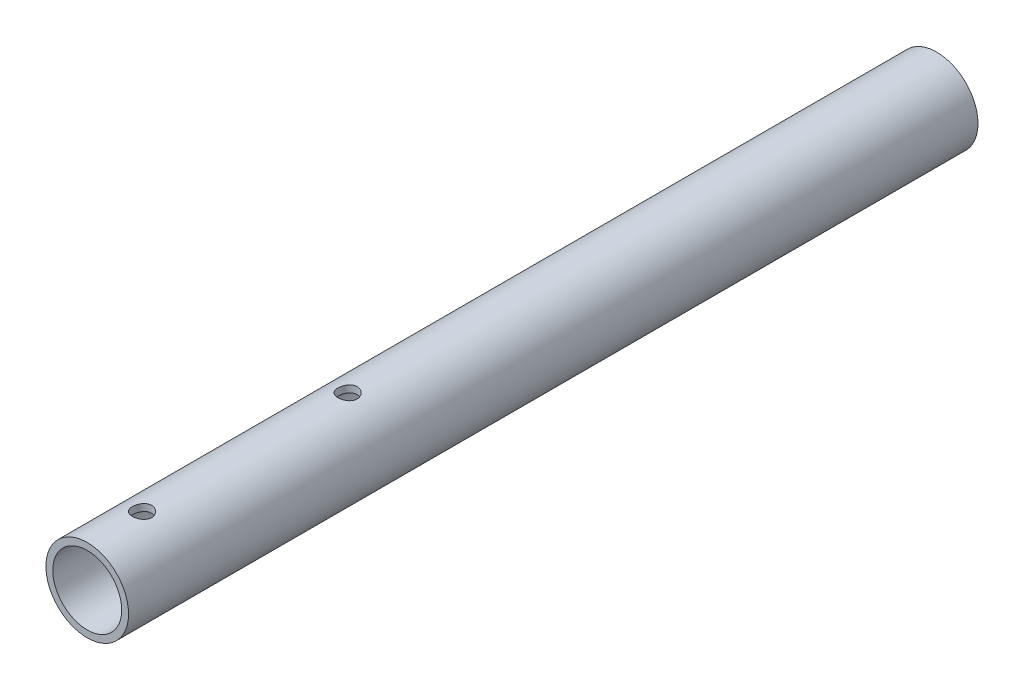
ISO-10303-21;
HEADER;
FILE_DESCRIPTION(('STEP AP214'),'2;1');
FILE_NAME('part.step','',(''),(''),'','','');
FILE_SCHEMA(('AUTOMOTIVE_DESIGN { 1 0 10303 214 1 1 1 1 }'));
ENDSEC;
DATA;
#1=APPLICATION_CONTEXT('core data for automotive mechanical design processes');
#2=APPLICATION_PROTOCOL_DEFINITION('international standard','automotive_design',2000,#1);
#3=PRODUCT_CONTEXT('',#1,'mechanical');
#4=PRODUCT('Part','Part','',(#3));
#5=PRODUCT_RELATED_PRODUCT_CATEGORY('part','',(#4));
#6=PRODUCT_DEFINITION_FORMATION('','',#4);
#7=PRODUCT_DEFINITION_CONTEXT('part definition',#1,'design');
#8=PRODUCT_DEFINITION('design','',#6,#7);
#9=PRODUCT_DEFINITION_SHAPE('','',#8);
#10=(LENGTH_UNIT() NAMED_UNIT(*) SI_UNIT(.MILLI.,.METRE.));
#11=(NAMED_UNIT(*) PLANE_ANGLE_UNIT() SI_UNIT($,.RADIAN.));
#12=(NAMED_UNIT(*) SI_UNIT($,.STERADIAN.) SOLID_ANGLE_UNIT());
#13=UNCERTAINTY_MEASURE_WITH_UNIT(LENGTH_MEASURE(1.E-05),#10,'distance_accuracy_value','');
#14=(GEOMETRIC_REPRESENTATION_CONTEXT(3) GLOBAL_UNCERTAINTY_ASSIGNED_CONTEXT((#13)) GLOBAL_UNIT_ASSIGNED_CONTEXT((#10,
#11,#12)) REPRESENTATION_CONTEXT('',''));
#15=CARTESIAN_POINT('',(0.,0.,0.));
#16=DIRECTION('',(0.,0.,1.));
#17=DIRECTION('',(1.,0.,0.));
#18=AXIS2_PLACEMENT_3D('',#15,#16,#17);
#19=CARTESIAN_POINT('',(0.,0.,370.));
#20=DIRECTION('',(0.,0.,-1.));
#21=DIRECTION('',(-1.,0.,0.));
#22=AXIS2_PLACEMENT_3D('',#19,#20,#21);
#23=CYLINDRICAL_SURFACE('',#22,30.15);
#24=CARTESIAN_POINT('',(0.,-30.15,337.));
#25=CARTESIAN_POINT('',(-0.19387479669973,-30.1500028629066,337.000005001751));
#26=CARTESIAN_POINT('',(-0.387692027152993,-30.1481270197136,336.991944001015));
#27=CARTESIAN_POINT('',(-0.773975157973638,-30.1406823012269,336.95977737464));
#28=CARTESIAN_POINT('',(-0.966440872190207,-30.1351129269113,336.935669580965));
#29=CARTESIAN_POINT('',(-1.34864266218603,-30.1204294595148,336.871588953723));
#30=CARTESIAN_POINT('',(-1.53837764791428,-30.1113139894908,336.831609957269));
#31=CARTESIAN_POINT('',(-1.91377423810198,-30.0897877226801,336.736096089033));
#32=CARTESIAN_POINT('',(-2.09943431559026,-30.077375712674,336.680555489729));
#33=CARTESIAN_POINT('',(-2.46503990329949,-30.0496196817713,336.554457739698));
#34=CARTESIAN_POINT('',(-2.64499357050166,-30.0342800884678,336.483923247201));
#35=CARTESIAN_POINT('',(-2.99832581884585,-30.0010673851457,336.328295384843));
#36=CARTESIAN_POINT('',(-3.17170194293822,-29.9831933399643,336.243196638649));
#37=CARTESIAN_POINT('',(-3.51059493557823,-29.9454050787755,336.059116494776));
#38=CARTESIAN_POINT('',(-3.67611489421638,-29.9254916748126,335.960140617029));
#39=CARTESIAN_POINT('',(-3.99835834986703,-29.8841435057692,335.74893536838));
#40=CARTESIAN_POINT('',(-4.15507846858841,-29.862708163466,335.636700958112));
#41=CARTESIAN_POINT('',(-4.46103577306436,-29.8185500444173,335.39790752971));
#42=CARTESIAN_POINT('',(-4.61011701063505,-29.795812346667,335.271151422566));
#43=CARTESIAN_POINT('',(-4.8971862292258,-29.7499783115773,335.00557885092));
#44=CARTESIAN_POINT('',(-5.03516912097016,-29.7268818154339,334.866756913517));
#45=CARTESIAN_POINT('',(-5.29906547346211,-29.6809762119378,334.578008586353));
#46=CARTESIAN_POINT('',(-5.42497772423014,-29.6581671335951,334.428081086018));
#47=CARTESIAN_POINT('',(-5.66381097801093,-29.6134851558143,334.118190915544));
#48=CARTESIAN_POINT('',(-5.77673782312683,-29.5916118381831,333.958232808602));
#49=CARTESIAN_POINT('',(-5.99026737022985,-29.5491320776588,333.627121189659));
#50=CARTESIAN_POINT('',(-6.09068970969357,-29.5285459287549,333.455848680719));
#51=CARTESIAN_POINT('',(-6.27667889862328,-29.4895715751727,333.105263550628));
#52=CARTESIAN_POINT('',(-6.36225149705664,-29.4711825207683,332.925954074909));
#53=CARTESIAN_POINT('',(-6.51794847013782,-29.4371398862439,332.560433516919));
#54=CARTESIAN_POINT('',(-6.58806838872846,-29.4214870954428,332.374220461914));
#55=CARTESIAN_POINT('',(-6.71223516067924,-29.3934083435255,331.996354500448));
#56=CARTESIAN_POINT('',(-6.76628857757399,-29.3809810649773,331.804703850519));
#57=CARTESIAN_POINT('',(-6.8571240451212,-29.359912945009,331.420608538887));
#58=CARTESIAN_POINT('',(-6.89418487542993,-29.3512111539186,331.228233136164));
#59=CARTESIAN_POINT('',(-6.95205285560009,-29.3375586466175,330.840993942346));
#60=CARTESIAN_POINT('',(-6.97286620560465,-29.3326064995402,330.646131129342));
#61=CARTESIAN_POINT('',(-6.99808468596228,-29.3266002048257,330.255273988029));
#62=CARTESIAN_POINT('',(-7.00248876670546,-29.3255463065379,330.059279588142));
#63=CARTESIAN_POINT('',(-6.99484749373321,-29.3273698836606,329.667631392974));
#64=CARTESIAN_POINT('',(-6.98280233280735,-29.3302473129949,329.471977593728));
#65=CARTESIAN_POINT('',(-6.9427904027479,-29.3397438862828,329.086535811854));
#66=CARTESIAN_POINT('',(-6.91516151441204,-29.3462836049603,328.89671067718));
#67=CARTESIAN_POINT('',(-6.84444860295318,-29.3628564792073,328.520049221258));
#68=CARTESIAN_POINT('',(-6.80135925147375,-29.3728908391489,328.333213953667));
#69=CARTESIAN_POINT('',(-6.70008569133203,-29.3961570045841,327.963951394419));
#70=CARTESIAN_POINT('',(-6.64190629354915,-29.4093877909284,327.781522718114));
#71=CARTESIAN_POINT('',(-6.51086850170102,-29.4386751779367,327.422175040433));
#72=CARTESIAN_POINT('',(-6.43800460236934,-29.4547328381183,327.245258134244));
#73=CARTESIAN_POINT('',(-6.27747076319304,-29.489365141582,326.896697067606));
#74=CARTESIAN_POINT('',(-6.18968052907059,-29.5079599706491,326.725110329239));
#75=CARTESIAN_POINT('',(-6.00032894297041,-29.5470454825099,326.389857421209));
#76=CARTESIAN_POINT('',(-5.8987625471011,-29.5675368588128,326.226194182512));
#77=CARTESIAN_POINT('',(-5.68261024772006,-29.6098389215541,325.907942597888));
#78=CARTESIAN_POINT('',(-5.56802738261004,-29.6316492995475,325.753352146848));
#79=CARTESIAN_POINT('',(-5.32654291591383,-29.6760090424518,325.454131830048));
#80=CARTESIAN_POINT('',(-5.19963671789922,-29.6985586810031,325.309505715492));
#81=CARTESIAN_POINT('',(-4.93116113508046,-29.7443294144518,325.027836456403));
#82=CARTESIAN_POINT('',(-4.7893118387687,-29.7675535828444,324.891060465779));
#83=CARTESIAN_POINT('',(-4.49449201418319,-29.8134919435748,324.629865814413));
#84=CARTESIAN_POINT('',(-4.34151757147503,-29.8362059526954,324.505451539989));
#85=CARTESIAN_POINT('',(-4.02553201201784,-29.8804791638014,324.269911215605));
#86=CARTESIAN_POINT('',(-3.86252223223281,-29.9020385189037,324.158783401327));
#87=CARTESIAN_POINT('',(-3.52754469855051,-29.9434033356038,323.950593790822));
#88=CARTESIAN_POINT('',(-3.35557707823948,-29.9632088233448,323.853531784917));
#89=CARTESIAN_POINT('',(-3.00335337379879,-30.0005636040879,323.673938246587));
#90=CARTESIAN_POINT('',(-2.82307509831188,-30.0181063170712,323.591448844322));
#91=CARTESIAN_POINT('',(-2.45601612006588,-30.0503645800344,323.442009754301));
#92=CARTESIAN_POINT('',(-2.26923773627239,-30.0650811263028,323.375054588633));
#93=CARTESIAN_POINT('',(-1.89045266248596,-30.0912732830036,323.257186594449));
#94=CARTESIAN_POINT('',(-1.69844574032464,-30.1027487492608,323.206274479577));
#95=CARTESIAN_POINT('',(-1.31062775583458,-30.1221254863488,323.120924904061));
#96=CARTESIAN_POINT('',(-1.11481676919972,-30.1300268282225,323.086487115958));
#97=CARTESIAN_POINT('',(-0.725284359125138,-30.1418907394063,323.034966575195));
#98=CARTESIAN_POINT('',(-0.531614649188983,-30.1459377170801,323.017511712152));
#99=CARTESIAN_POINT('',(-0.143383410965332,-30.1502842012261,322.998769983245));
#100=CARTESIAN_POINT('',(0.0511784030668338,-30.1505824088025,322.997488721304));
#101=CARTESIAN_POINT('',(0.439650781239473,-30.1474199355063,323.01111797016));
#102=CARTESIAN_POINT('',(0.633561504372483,-30.1439602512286,323.026024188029));
#103=CARTESIAN_POINT('',(1.01937697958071,-30.1333803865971,323.071897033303));
#104=CARTESIAN_POINT('',(1.2112816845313,-30.1262601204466,323.102864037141));
#105=CARTESIAN_POINT('',(1.58930339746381,-30.1086693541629,323.180112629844));
#106=CARTESIAN_POINT('',(1.77546284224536,-30.0982421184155,323.226196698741));
#107=CARTESIAN_POINT('',(2.14318946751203,-30.0742945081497,323.333410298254));
#108=CARTESIAN_POINT('',(2.32475669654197,-30.0607741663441,323.394539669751));
#109=CARTESIAN_POINT('',(2.68209041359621,-30.0310013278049,323.531383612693));
#110=CARTESIAN_POINT('',(2.85785646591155,-30.014748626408,323.607099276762));
#111=CARTESIAN_POINT('',(3.20241743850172,-29.9799434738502,323.772556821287));
#112=CARTESIAN_POINT('',(3.37121234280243,-29.9613910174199,323.86229873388));
#113=CARTESIAN_POINT('',(3.70337468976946,-29.9221645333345,324.056715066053));
#114=CARTESIAN_POINT('',(3.86661274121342,-29.9014614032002,324.161604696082));
#115=CARTESIAN_POINT('',(4.18365490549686,-29.8587527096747,324.384435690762));
#116=CARTESIAN_POINT('',(4.33746220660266,-29.8367475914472,324.502372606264));
#117=CARTESIAN_POINT('',(4.63478474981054,-29.7920104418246,324.750591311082));
#118=CARTESIAN_POINT('',(4.77829496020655,-29.7692780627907,324.880879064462));
#119=CARTESIAN_POINT('',(5.05396439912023,-29.7237188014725,325.152844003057));
#120=CARTESIAN_POINT('',(5.18612760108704,-29.7008919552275,325.294517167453));
#121=CARTESIAN_POINT('',(5.44099096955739,-29.6552733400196,325.591517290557));
#122=CARTESIAN_POINT('',(5.56342884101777,-29.6324927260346,325.74707118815));
#123=CARTESIAN_POINT('',(5.79472354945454,-29.5881318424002,326.068041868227));
#124=CARTESIAN_POINT('',(5.90358534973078,-29.5665511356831,326.233455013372));
#125=CARTESIAN_POINT('',(6.10703178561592,-29.5252002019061,326.57313994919));
#126=CARTESIAN_POINT('',(6.20161128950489,-29.5054306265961,326.747414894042));
#127=CARTESIAN_POINT('',(6.37569947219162,-29.4683029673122,327.103499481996));
#128=CARTESIAN_POINT('',(6.45521414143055,-29.4509439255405,327.28530609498));
#129=CARTESIAN_POINT('',(6.59819826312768,-29.4192388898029,327.654217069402));
#130=CARTESIAN_POINT('',(6.66175391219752,-29.4048767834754,327.841286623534));
#131=CARTESIAN_POINT('',(6.77285249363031,-29.3794863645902,328.220268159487));
#132=CARTESIAN_POINT('',(6.82040151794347,-29.368456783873,328.412178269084));
#133=CARTESIAN_POINT('',(6.89912182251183,-29.3500639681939,328.799510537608));
#134=CARTESIAN_POINT('',(6.93029252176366,-29.3427008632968,328.994932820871));
#135=CARTESIAN_POINT('',(6.97598348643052,-29.3318718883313,329.387820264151));
#136=CARTESIAN_POINT('',(6.99050408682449,-29.3284059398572,329.585285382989));
#137=CARTESIAN_POINT('',(7.00261621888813,-29.3255162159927,329.97584310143));
#138=CARTESIAN_POINT('',(7.00061977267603,-29.325994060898,330.168922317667));
#139=CARTESIAN_POINT('',(6.98068855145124,-29.3307448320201,330.554277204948));
#140=CARTESIAN_POINT('',(6.9627482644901,-29.3350190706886,330.746552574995));
#141=CARTESIAN_POINT('',(6.91108133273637,-29.3472342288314,331.128774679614));
#142=CARTESIAN_POINT('',(6.87736079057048,-29.3551737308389,331.318722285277));
#143=CARTESIAN_POINT('',(6.79439590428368,-29.3744871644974,331.695090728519));
#144=CARTESIAN_POINT('',(6.74514579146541,-29.3858623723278,331.881510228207));
#145=CARTESIAN_POINT('',(6.63179049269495,-29.4116509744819,332.248571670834));
#146=CARTESIAN_POINT('',(6.56775780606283,-29.4260495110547,332.429237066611));
#147=CARTESIAN_POINT('',(6.42517053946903,-29.4575119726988,332.784572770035));
#148=CARTESIAN_POINT('',(6.34661098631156,-29.4745768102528,332.95924100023));
#149=CARTESIAN_POINT('',(6.17556390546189,-29.5108886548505,333.301360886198));
#150=CARTESIAN_POINT('',(6.08307757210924,-29.5301354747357,333.468813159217));
#151=CARTESIAN_POINT('',(5.88481632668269,-29.5702834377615,333.795449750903));
#152=CARTESIAN_POINT('',(5.77904110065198,-29.591184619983,333.954633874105));
#153=CARTESIAN_POINT('',(5.55235005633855,-29.6345663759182,334.267263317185));
#154=CARTESIAN_POINT('',(5.4311435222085,-29.6570721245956,334.420494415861));
#155=CARTESIAN_POINT('',(5.17643689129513,-29.7025878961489,334.716202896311));
#156=CARTESIAN_POINT('',(5.04294077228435,-29.7255977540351,334.858683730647));
#157=CARTESIAN_POINT('',(4.76442556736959,-29.7715077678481,335.132090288));
#158=CARTESIAN_POINT('',(4.61939985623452,-29.7944078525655,335.263009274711));
#159=CARTESIAN_POINT('',(4.31890064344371,-29.8394481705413,335.512276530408));
#160=CARTESIAN_POINT('',(4.1634309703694,-29.8615886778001,335.630629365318));
#161=CARTESIAN_POINT('',(3.84053731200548,-29.9048441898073,335.855732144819));
#162=CARTESIAN_POINT('',(3.67296579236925,-29.9259380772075,335.962274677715));
#163=CARTESIAN_POINT('',(3.32926143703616,-29.9661216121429,336.160794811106));
#164=CARTESIAN_POINT('',(3.15313178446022,-29.9852119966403,336.25277777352));
#165=CARTESIAN_POINT('',(2.79355787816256,-30.020845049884,336.421482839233));
#166=CARTESIAN_POINT('',(2.61011732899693,-30.0373889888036,336.498212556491));
#167=CARTESIAN_POINT('',(2.23721536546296,-30.0674641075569,336.635841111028));
#168=CARTESIAN_POINT('',(2.04775496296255,-30.0809957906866,336.696742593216));
#169=CARTESIAN_POINT('',(1.55446210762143,-30.1114115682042,336.832369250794));
#170=CARTESIAN_POINT('',(1.24709575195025,-30.1257979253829,336.895131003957));
#171=CARTESIAN_POINT('',(0.626435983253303,-30.1450895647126,336.978941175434));
#172=CARTESIAN_POINT('',(0.313142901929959,-30.1499953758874,336.999991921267));
#173=CARTESIAN_POINT('',(0.,-30.15,337.));
#174=B_SPLINE_CURVE_WITH_KNOTS('',3,(#24,#25,#26,#27,#28,#29,#30,#31,#32,#33,#34,#35,#36,#37,
#38,#39,#40,#41,#42,#43,#44,#45,#46,#47,#48,#49,#50,#51,#52,#53,#54,#55,#56,#57,#58,#59,#60,#61,
#62,#63,#64,#65,#66,#67,#68,#69,#70,#71,#72,#73,#74,#75,#76,#77,#78,#79,#80,#81,#82,#83,#84,#85,
#86,#87,#88,#89,#90,#91,#92,#93,#94,#95,#96,#97,#98,#99,#100,#101,#102,#103,#104,#105,#106,#107,
#108,#109,#110,#111,#112,#113,#114,#115,#116,#117,#118,#119,#120,#121,#122,#123,#124,#125,#126,
#127,#128,#129,#130,#131,#132,#133,#134,#135,#136,#137,#138,#139,#140,#141,#142,#143,#144,#145,
#146,#147,#148,#149,#150,#151,#152,#153,#154,#155,#156,#157,#158,#159,#160,#161,#162,#163,#164,
#165,#166,#167,#168,#169,#170,#171,#172,#173),.UNSPECIFIED.,.T.,.F.,(4,2,2,2,2,2,2,2,2,2,2,2,2,
2,2,2,2,2,2,2,2,2,2,2,2,2,2,2,2,2,2,2,2,2,2,2,2,2,2,2,2,2,2,2,2,2,2,2,2,2,2,2,2,2,2,2,2,2,2,2,2,
2,2,2,2,2,2,2,2,2,2,2,2,2,4),(0.,0.581348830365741,1.16277622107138,1.74442960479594,
2.32629735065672,2.90729197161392,3.48850152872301,4.06948054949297,4.65068110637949,
5.24099883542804,5.83158573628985,6.42223177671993,7.01261103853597,7.61070637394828,
8.20856964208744,8.8066050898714,9.40439588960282,9.99199372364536,10.5793672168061,
11.1667782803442,11.7541824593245,12.3293149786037,12.9046459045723,13.4797936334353,
14.0551573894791,14.6353993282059,15.2158542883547,15.7961740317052,16.3767110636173,
16.9712551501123,17.566009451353,18.1606846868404,18.755351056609,19.3517094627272,
19.9478572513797,20.5440315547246,21.1401940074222,21.7229783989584,22.3059647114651,
22.8887964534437,23.4716418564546,24.0471564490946,24.6226649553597,25.1982165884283,
25.7737695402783,26.3584962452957,26.9430241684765,27.5278358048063,28.1124418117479,
28.7095297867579,29.3063988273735,29.9034818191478,30.5003268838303,31.0938754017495,
31.6871977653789,32.2805411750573,32.8738726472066,33.4524487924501,34.0312250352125,
34.6097776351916,35.1885454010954,35.7645328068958,36.3407177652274,36.9168533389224,
37.4930025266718,38.0823156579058,38.6714387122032,39.2609027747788,39.8501519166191,
40.4485009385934,41.0466290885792,41.6444579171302,42.2421867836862,43.181222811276,
44.1202064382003),.UNSPECIFIED.);
#175=CARTESIAN_POINT('',(0.,-30.15,337.));
#176=VERTEX_POINT('',#175);
#177=EDGE_CURVE('E91',#176,#176,#174,.T.);
#178=ORIENTED_EDGE('',*,*,#177,.F.);
#179=EDGE_LOOP('',(#178));
#180=FACE_BOUND('',#179,.T.);
#181=CARTESIAN_POINT('',(0.,30.15,173.));
#182=CARTESIAN_POINT('',(0.19387479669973,30.1500028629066,172.999994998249));
#183=CARTESIAN_POINT('',(0.387692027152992,30.1481270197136,173.008055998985));
#184=CARTESIAN_POINT('',(0.773975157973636,30.1406823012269,173.04022262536));
#185=CARTESIAN_POINT('',(0.966440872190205,30.1351129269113,173.064330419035));
#186=CARTESIAN_POINT('',(1.34864266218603,30.1204294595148,173.128411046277));
#187=CARTESIAN_POINT('',(1.53837764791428,30.1113139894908,173.168390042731));
#188=CARTESIAN_POINT('',(1.91377423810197,30.0897877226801,173.263903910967));
#189=CARTESIAN_POINT('',(2.09943431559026,30.077375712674,173.319444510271));
#190=CARTESIAN_POINT('',(2.46503990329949,30.0496196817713,173.445542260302));
#191=CARTESIAN_POINT('',(2.64499357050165,30.0342800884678,173.516076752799));
#192=CARTESIAN_POINT('',(2.99832581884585,30.0010673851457,173.671704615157));
#193=CARTESIAN_POINT('',(3.17170194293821,29.9831933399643,173.756803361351));
#194=CARTESIAN_POINT('',(3.51059493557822,29.9454050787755,173.940883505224));
#195=CARTESIAN_POINT('',(3.67611489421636,29.9254916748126,174.039859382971));
#196=CARTESIAN_POINT('',(3.99835834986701,29.8841435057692,174.25106463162));
#197=CARTESIAN_POINT('',(4.15507846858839,29.862708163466,174.363299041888));
#198=CARTESIAN_POINT('',(4.46103577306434,29.8185500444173,174.60209247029));
#199=CARTESIAN_POINT('',(4.61011701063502,29.795812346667,174.728848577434));
#200=CARTESIAN_POINT('',(4.89718622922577,29.7499783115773,174.99442114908));
#201=CARTESIAN_POINT('',(5.03516912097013,29.7268818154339,175.133243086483));
#202=CARTESIAN_POINT('',(5.2990654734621,29.6809762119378,175.421991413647));
#203=CARTESIAN_POINT('',(5.42497772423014,29.6581671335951,175.571918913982));
#204=CARTESIAN_POINT('',(5.66381097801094,29.6134851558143,175.881809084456));
#205=CARTESIAN_POINT('',(5.77673782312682,29.5916118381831,176.041767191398));
#206=CARTESIAN_POINT('',(5.99026737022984,29.5491320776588,176.372878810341));
#207=CARTESIAN_POINT('',(6.09068970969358,29.5285459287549,176.544151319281));
#208=CARTESIAN_POINT('',(6.27667889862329,29.4895715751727,176.894736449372));
#209=CARTESIAN_POINT('',(6.36225149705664,29.4711825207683,177.074045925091));
#210=CARTESIAN_POINT('',(6.51794847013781,29.4371398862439,177.439566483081));
#211=CARTESIAN_POINT('',(6.58806838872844,29.4214870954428,177.625779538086));
#212=CARTESIAN_POINT('',(6.71223516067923,29.3934083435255,178.003645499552));
#213=CARTESIAN_POINT('',(6.76628857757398,29.3809810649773,178.195296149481));
#214=CARTESIAN_POINT('',(6.85712404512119,29.359912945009,178.579391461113));
#215=CARTESIAN_POINT('',(6.89418487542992,29.3512111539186,178.771766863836));
#216=CARTESIAN_POINT('',(6.95205285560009,29.3375586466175,179.159006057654));
#217=CARTESIAN_POINT('',(6.97286620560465,29.3326064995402,179.353868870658));
#218=CARTESIAN_POINT('',(6.99808468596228,29.3266002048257,179.744726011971));
#219=CARTESIAN_POINT('',(7.00248876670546,29.3255463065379,179.940720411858));
#220=CARTESIAN_POINT('',(6.99484749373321,29.3273698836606,180.332368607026));
#221=CARTESIAN_POINT('',(6.98280233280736,29.3302473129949,180.528022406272));
#222=CARTESIAN_POINT('',(6.9427904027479,29.3397438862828,180.913464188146));
#223=CARTESIAN_POINT('',(6.91516151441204,29.3462836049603,181.10328932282));
#224=CARTESIAN_POINT('',(6.84444860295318,29.3628564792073,181.479950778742));
#225=CARTESIAN_POINT('',(6.80135925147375,29.3728908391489,181.666786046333));
#226=CARTESIAN_POINT('',(6.70008569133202,29.3961570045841,182.036048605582));
#227=CARTESIAN_POINT('',(6.64190629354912,29.4093877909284,182.218477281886));
#228=CARTESIAN_POINT('',(6.51086850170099,29.4386751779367,182.577824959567));
#229=CARTESIAN_POINT('',(6.43800460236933,29.4547328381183,182.754741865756));
#230=CARTESIAN_POINT('',(6.27747076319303,29.489365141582,183.103302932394));
#231=CARTESIAN_POINT('',(6.18968052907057,29.5079599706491,183.274889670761));
#232=CARTESIAN_POINT('',(6.00032894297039,29.5470454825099,183.610142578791));
#233=CARTESIAN_POINT('',(5.89876254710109,29.5675368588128,183.773805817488));
#234=CARTESIAN_POINT('',(5.68261024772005,29.6098389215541,184.092057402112));
#235=CARTESIAN_POINT('',(5.56802738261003,29.6316492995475,184.246647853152));
#236=CARTESIAN_POINT('',(5.32654291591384,29.6760090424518,184.545868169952));
#237=CARTESIAN_POINT('',(5.19963671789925,29.6985586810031,184.690494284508));
#238=CARTESIAN_POINT('',(4.9311611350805,29.7443294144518,184.972163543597));
#239=CARTESIAN_POINT('',(4.78931183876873,29.7675535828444,185.108939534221));
#240=CARTESIAN_POINT('',(4.49449201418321,29.8134919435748,185.370134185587));
#241=CARTESIAN_POINT('',(4.34151757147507,29.8362059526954,185.494548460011));
#242=CARTESIAN_POINT('',(4.02553201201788,29.8804791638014,185.730088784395));
#243=CARTESIAN_POINT('',(3.86252223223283,29.9020385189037,185.841216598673));
#244=CARTESIAN_POINT('',(3.52754469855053,29.9434033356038,186.049406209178));
#245=CARTESIAN_POINT('',(3.35557707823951,29.9632088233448,186.146468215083));
#246=CARTESIAN_POINT('',(3.00335337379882,30.0005636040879,186.326061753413));
#247=CARTESIAN_POINT('',(2.8230750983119,30.0181063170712,186.408551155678));
#248=CARTESIAN_POINT('',(2.45601612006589,30.0503645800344,186.557990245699));
#249=CARTESIAN_POINT('',(2.2692377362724,30.0650811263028,186.624945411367));
#250=CARTESIAN_POINT('',(1.89045266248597,30.0912732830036,186.742813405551));
#251=CARTESIAN_POINT('',(1.69844574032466,30.1027487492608,186.793725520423));
#252=CARTESIAN_POINT('',(1.31062775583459,30.1221254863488,186.879075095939));
#253=CARTESIAN_POINT('',(1.11481676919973,30.1300268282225,186.913512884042));
#254=CARTESIAN_POINT('',(0.725284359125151,30.1418907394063,186.965033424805));
#255=CARTESIAN_POINT('',(0.531614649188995,30.1459377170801,186.982488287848));
#256=CARTESIAN_POINT('',(0.143383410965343,30.1502842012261,187.001230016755));
#257=CARTESIAN_POINT('',(-0.0511784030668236,30.1505824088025,187.002511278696));
#258=CARTESIAN_POINT('',(-0.439650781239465,30.1474199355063,186.98888202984));
#259=CARTESIAN_POINT('',(-0.633561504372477,30.1439602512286,186.973975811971));
#260=CARTESIAN_POINT('',(-1.0193769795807,30.1333803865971,186.928102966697));
#261=CARTESIAN_POINT('',(-1.2112816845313,30.1262601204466,186.897135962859));
#262=CARTESIAN_POINT('',(-1.5893033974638,30.1086693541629,186.819887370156));
#263=CARTESIAN_POINT('',(-1.77546284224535,30.0982421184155,186.773803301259));
#264=CARTESIAN_POINT('',(-2.14318946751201,30.0742945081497,186.666589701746));
#265=CARTESIAN_POINT('',(-2.32475669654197,30.0607741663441,186.605460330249));
#266=CARTESIAN_POINT('',(-2.68209041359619,30.0310013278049,186.468616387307));
#267=CARTESIAN_POINT('',(-2.85785646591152,30.014748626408,186.392900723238));
#268=CARTESIAN_POINT('',(-3.20241743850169,29.9799434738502,186.227443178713));
#269=CARTESIAN_POINT('',(-3.37121234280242,29.9613910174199,186.13770126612));
#270=CARTESIAN_POINT('',(-3.70337468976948,29.9221645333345,185.943284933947));
#271=CARTESIAN_POINT('',(-3.86661274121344,29.9014614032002,185.838395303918));
#272=CARTESIAN_POINT('',(-4.18365490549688,29.8587527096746,185.615564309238));
#273=CARTESIAN_POINT('',(-4.33746220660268,29.8367475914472,185.497627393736));
#274=CARTESIAN_POINT('',(-4.63478474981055,29.7920104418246,185.249408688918));
#275=CARTESIAN_POINT('',(-4.77829496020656,29.7692780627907,185.119120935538));
#276=CARTESIAN_POINT('',(-5.05396439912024,29.7237188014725,184.847155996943));
#277=CARTESIAN_POINT('',(-5.18612760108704,29.7008919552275,184.705482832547));
#278=CARTESIAN_POINT('',(-5.44099096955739,29.6552733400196,184.408482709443));
#279=CARTESIAN_POINT('',(-5.56342884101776,29.6324927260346,184.25292881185));
#280=CARTESIAN_POINT('',(-5.79472354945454,29.5881318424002,183.931958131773));
#281=CARTESIAN_POINT('',(-5.90358534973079,29.566551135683,183.766544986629));
#282=CARTESIAN_POINT('',(-6.10703178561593,29.5252002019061,183.42686005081));
#283=CARTESIAN_POINT('',(-6.20161128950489,29.5054306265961,183.252585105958));
#284=CARTESIAN_POINT('',(-6.37569947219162,29.4683029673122,182.896500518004));
#285=CARTESIAN_POINT('',(-6.45521414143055,29.4509439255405,182.71469390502));
#286=CARTESIAN_POINT('',(-6.59819826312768,29.4192388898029,182.345782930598));
#287=CARTESIAN_POINT('',(-6.66175391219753,29.4048767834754,182.158713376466));
#288=CARTESIAN_POINT('',(-6.77285249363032,29.3794863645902,181.779731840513));
#289=CARTESIAN_POINT('',(-6.82040151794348,29.368456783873,181.587821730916));
#290=CARTESIAN_POINT('',(-6.89912182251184,29.3500639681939,181.200489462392));
#291=CARTESIAN_POINT('',(-6.93029252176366,29.3427008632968,181.005067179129));
#292=CARTESIAN_POINT('',(-6.97598348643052,29.3318718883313,180.612179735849));
#293=CARTESIAN_POINT('',(-6.99050408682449,29.3284059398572,180.414714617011));
#294=CARTESIAN_POINT('',(-7.00261621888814,29.3255162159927,180.02415689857));
#295=CARTESIAN_POINT('',(-7.00061977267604,29.325994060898,179.831077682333));
#296=CARTESIAN_POINT('',(-6.98068855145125,29.3307448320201,179.445722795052));
#297=CARTESIAN_POINT('',(-6.9627482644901,29.3350190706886,179.253447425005));
#298=CARTESIAN_POINT('',(-6.91108133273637,29.3472342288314,178.871225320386));
#299=CARTESIAN_POINT('',(-6.87736079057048,29.3551737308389,178.681277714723));
#300=CARTESIAN_POINT('',(-6.79439590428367,29.3744871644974,178.304909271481));
#301=CARTESIAN_POINT('',(-6.74514579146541,29.3858623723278,178.118489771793));
#302=CARTESIAN_POINT('',(-6.63179049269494,29.4116509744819,177.751428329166));
#303=CARTESIAN_POINT('',(-6.56775780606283,29.4260495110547,177.570762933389));
#304=CARTESIAN_POINT('',(-6.42517053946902,29.4575119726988,177.215427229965));
#305=CARTESIAN_POINT('',(-6.34661098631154,29.4745768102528,177.04075899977));
#306=CARTESIAN_POINT('',(-6.17556390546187,29.5108886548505,176.698639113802));
#307=CARTESIAN_POINT('',(-6.08307757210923,29.5301354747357,176.531186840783));
#308=CARTESIAN_POINT('',(-5.88481632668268,29.5702834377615,176.204550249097));
#309=CARTESIAN_POINT('',(-5.77904110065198,29.591184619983,176.045366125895));
#310=CARTESIAN_POINT('',(-5.55235005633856,29.6345663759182,175.732736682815));
#311=CARTESIAN_POINT('',(-5.43114352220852,29.6570721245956,175.579505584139));
#312=CARTESIAN_POINT('',(-5.17643689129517,29.7025878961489,175.283797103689));
#313=CARTESIAN_POINT('',(-5.04294077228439,29.725597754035,175.141316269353));
#314=CARTESIAN_POINT('',(-4.76442556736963,29.7715077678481,174.867909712));
#315=CARTESIAN_POINT('',(-4.61939985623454,29.7944078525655,174.736990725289));
#316=CARTESIAN_POINT('',(-4.31890064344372,29.8394481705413,174.487723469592));
#317=CARTESIAN_POINT('',(-4.16343097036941,29.8615886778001,174.369370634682));
#318=CARTESIAN_POINT('',(-3.8405373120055,29.9048441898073,174.144267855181));
#319=CARTESIAN_POINT('',(-3.67296579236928,29.9259380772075,174.037725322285));
#320=CARTESIAN_POINT('',(-3.32926143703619,29.9661216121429,173.839205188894));
#321=CARTESIAN_POINT('',(-3.15313178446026,29.9852119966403,173.74722222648));
#322=CARTESIAN_POINT('',(-2.7935578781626,30.020845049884,173.578517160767));
#323=CARTESIAN_POINT('',(-2.61011732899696,30.0373889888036,173.501787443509));
#324=CARTESIAN_POINT('',(-2.23721536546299,30.0674641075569,173.364158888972));
#325=CARTESIAN_POINT('',(-2.04775496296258,30.0809957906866,173.303257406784));
#326=CARTESIAN_POINT('',(-1.55446210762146,30.1114115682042,173.167630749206));
#327=CARTESIAN_POINT('',(-1.24709575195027,30.1257979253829,173.104868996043));
#328=CARTESIAN_POINT('',(-0.626435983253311,30.1450895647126,173.021058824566));
#329=CARTESIAN_POINT('',(-0.313142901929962,30.1499953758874,173.000008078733));
#330=CARTESIAN_POINT('',(0.,30.15,173.));
#331=B_SPLINE_CURVE_WITH_KNOTS('',3,(#181,#182,#183,#184,#185,#186,#187,#188,#189,#190,#191,
#192,#193,#194,#195,#196,#197,#198,#199,#200,#201,#202,#203,#204,#205,#206,#207,#208,#209,#210,
#211,#212,#213,#214,#215,#216,#217,#218,#219,#220,#221,#222,#223,#224,#225,#226,#227,#228,#229,
#230,#231,#232,#233,#234,#235,#236,#237,#238,#239,#240,#241,#242,#243,#244,#245,#246,#247,#248,
#249,#250,#251,#252,#253,#254,#255,#256,#257,#258,#259,#260,#261,#262,#263,#264,#265,#266,#267,
#268,#269,#270,#271,#272,#273,#274,#275,#276,#277,#278,#279,#280,#281,#282,#283,#284,#285,#286,
#287,#288,#289,#290,#291,#292,#293,#294,#295,#296,#297,#298,#299,#300,#301,#302,#303,#304,#305,
#306,#307,#308,#309,#310,#311,#312,#313,#314,#315,#316,#317,#318,#319,#320,#321,#322,#323,#324,
#325,#326,#327,#328,#329,#330),.UNSPECIFIED.,.T.,.F.,(4,2,2,2,2,2,2,2,2,2,2,2,2,2,2,2,2,2,2,2,2,
2,2,2,2,2,2,2,2,2,2,2,2,2,2,2,2,2,2,2,2,2,2,2,2,2,2,2,2,2,2,2,2,2,2,2,2,2,2,2,2,2,2,2,2,2,2,2,2,
2,2,2,2,2,4),(0.,0.58134883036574,1.16277622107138,1.74442960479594,2.32629735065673,
2.90729197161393,3.48850152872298,4.06948054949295,4.65068110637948,5.24099883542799,
5.83158573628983,6.42223177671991,7.01261103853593,7.61070637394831,8.20856964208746,
8.80660508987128,9.40439588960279,9.99199372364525,10.5793672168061,11.1667782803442,
11.7541824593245,12.3293149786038,12.9046459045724,13.4797936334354,14.0551573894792,
14.635399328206,15.2158542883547,15.7961740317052,16.3767110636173,16.9712551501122,
17.566009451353,18.1606846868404,18.755351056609,19.3517094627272,19.9478572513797,
20.5440315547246,21.1401940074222,21.7229783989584,22.3059647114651,22.8887964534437,
23.4716418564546,24.0471564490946,24.6226649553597,25.1982165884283,25.7737695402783,
26.3584962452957,26.9430241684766,27.5278358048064,28.1124418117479,28.7095297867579,
29.3063988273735,29.9034818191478,30.5003268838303,31.0938754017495,31.687197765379,
32.2805411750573,32.8738726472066,33.4524487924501,34.0312250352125,34.6097776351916,
35.1885454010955,35.7645328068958,36.3407177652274,36.9168533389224,37.4930025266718,
38.0823156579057,38.6714387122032,39.2609027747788,39.8501519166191,40.4485009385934,
41.0466290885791,41.6444579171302,42.2421867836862,43.181222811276,44.1202064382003),.UNSPECIFIED.);
#332=CARTESIAN_POINT('',(0.,30.15,173.));
#333=VERTEX_POINT('',#332);
#334=EDGE_CURVE('E44',#333,#333,#331,.T.);
#335=ORIENTED_EDGE('',*,*,#334,.T.);
#336=EDGE_LOOP('',(#335));
#337=FACE_BOUND('',#336,.T.);
#338=CARTESIAN_POINT('',(0.,0.,370.));
#339=DIRECTION('',(0.,0.,1.));
#340=DIRECTION('',(1.,0.,0.));
#341=AXIS2_PLACEMENT_3D('',#338,#339,#340);
#342=CIRCLE('',#341,30.15);
#343=CARTESIAN_POINT('',(30.15,0.,370.));
#344=VERTEX_POINT('',#343);
#345=EDGE_CURVE('E10',#344,#344,#342,.T.);
#346=ORIENTED_EDGE('',*,*,#345,.F.);
#347=EDGE_LOOP('',(#346));
#348=FACE_BOUND('',#347,.T.);
#349=CARTESIAN_POINT('',(0.,0.,-250.));
#350=DIRECTION('',(0.,0.,1.));
#351=DIRECTION('',(1.,0.,0.));
#352=AXIS2_PLACEMENT_3D('',#349,#350,#351);
#353=CIRCLE('',#352,30.15);
#354=CARTESIAN_POINT('',(30.15,0.,-250.));
#355=VERTEX_POINT('',#354);
#356=EDGE_CURVE('E34',#355,#355,#353,.T.);
#357=ORIENTED_EDGE('',*,*,#356,.T.);
#358=EDGE_LOOP('',(#357));
#359=FACE_BOUND('',#358,.T.);
#360=CARTESIAN_POINT('',(0.,-30.15,187.));
#361=CARTESIAN_POINT('',(-0.19387479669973,-30.1500028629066,187.000005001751));
#362=CARTESIAN_POINT('',(-0.387692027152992,-30.1481270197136,186.991944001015));
#363=CARTESIAN_POINT('',(-0.773975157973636,-30.1406823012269,186.95977737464));
#364=CARTESIAN_POINT('',(-0.966440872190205,-30.1351129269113,186.935669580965));
#365=CARTESIAN_POINT('',(-1.34864266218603,-30.1204294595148,186.871588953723));
#366=CARTESIAN_POINT('',(-1.53837764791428,-30.1113139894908,186.831609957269));
#367=CARTESIAN_POINT('',(-1.91377423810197,-30.0897877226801,186.736096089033));
#368=CARTESIAN_POINT('',(-2.09943431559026,-30.077375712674,186.680555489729));
#369=CARTESIAN_POINT('',(-2.46503990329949,-30.0496196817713,186.554457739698));
#370=CARTESIAN_POINT('',(-2.64499357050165,-30.0342800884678,186.483923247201));
#371=CARTESIAN_POINT('',(-2.99832581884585,-30.0010673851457,186.328295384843));
#372=CARTESIAN_POINT('',(-3.17170194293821,-29.9831933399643,186.243196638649));
#373=CARTESIAN_POINT('',(-3.51059493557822,-29.9454050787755,186.059116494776));
#374=CARTESIAN_POINT('',(-3.67611489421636,-29.9254916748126,185.960140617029));
#375=CARTESIAN_POINT('',(-3.99835834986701,-29.8841435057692,185.74893536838));
#376=CARTESIAN_POINT('',(-4.15507846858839,-29.862708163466,185.636700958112));
#377=CARTESIAN_POINT('',(-4.46103577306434,-29.8185500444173,185.39790752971));
#378=CARTESIAN_POINT('',(-4.61011701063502,-29.795812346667,185.271151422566));
#379=CARTESIAN_POINT('',(-4.89718622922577,-29.7499783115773,185.00557885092));
#380=CARTESIAN_POINT('',(-5.03516912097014,-29.7268818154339,184.866756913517));
#381=CARTESIAN_POINT('',(-5.29906547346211,-29.6809762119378,184.578008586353));
#382=CARTESIAN_POINT('',(-5.42497772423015,-29.6581671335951,184.428081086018));
#383=CARTESIAN_POINT('',(-5.66381097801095,-29.6134851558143,184.118190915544));
#384=CARTESIAN_POINT('',(-5.77673782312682,-29.5916118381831,183.958232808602));
#385=CARTESIAN_POINT('',(-5.99026737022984,-29.5491320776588,183.627121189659));
#386=CARTESIAN_POINT('',(-6.09068970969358,-29.5285459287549,183.455848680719));
#387=CARTESIAN_POINT('',(-6.27667889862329,-29.4895715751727,183.105263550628));
#388=CARTESIAN_POINT('',(-6.36225149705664,-29.4711825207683,182.925954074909));
#389=CARTESIAN_POINT('',(-6.51794847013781,-29.4371398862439,182.560433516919));
#390=CARTESIAN_POINT('',(-6.58806838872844,-29.4214870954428,182.374220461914));
#391=CARTESIAN_POINT('',(-6.71223516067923,-29.3934083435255,181.996354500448));
#392=CARTESIAN_POINT('',(-6.76628857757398,-29.3809810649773,181.804703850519));
#393=CARTESIAN_POINT('',(-6.85712404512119,-29.359912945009,181.420608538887));
#394=CARTESIAN_POINT('',(-6.89418487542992,-29.3512111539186,181.228233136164));
#395=CARTESIAN_POINT('',(-6.95205285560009,-29.3375586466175,180.840993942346));
#396=CARTESIAN_POINT('',(-6.97286620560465,-29.3326064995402,180.646131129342));
#397=CARTESIAN_POINT('',(-6.99808468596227,-29.3266002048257,180.255273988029));
#398=CARTESIAN_POINT('',(-7.00248876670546,-29.3255463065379,180.059279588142));
#399=CARTESIAN_POINT('',(-6.99484749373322,-29.3273698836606,179.667631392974));
#400=CARTESIAN_POINT('',(-6.98280233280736,-29.3302473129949,179.471977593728));
#401=CARTESIAN_POINT('',(-6.9427904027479,-29.3397438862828,179.086535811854));
#402=CARTESIAN_POINT('',(-6.91516151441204,-29.3462836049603,178.89671067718));
#403=CARTESIAN_POINT('',(-6.84444860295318,-29.3628564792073,178.520049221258));
#404=CARTESIAN_POINT('',(-6.80135925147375,-29.3728908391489,178.333213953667));
#405=CARTESIAN_POINT('',(-6.70008569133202,-29.3961570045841,177.963951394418));
#406=CARTESIAN_POINT('',(-6.64190629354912,-29.4093877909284,177.781522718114));
#407=CARTESIAN_POINT('',(-6.51086850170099,-29.4386751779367,177.422175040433));
#408=CARTESIAN_POINT('',(-6.43800460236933,-29.4547328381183,177.245258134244));
#409=CARTESIAN_POINT('',(-6.27747076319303,-29.489365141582,176.896697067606));
#410=CARTESIAN_POINT('',(-6.18968052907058,-29.5079599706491,176.725110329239));
#411=CARTESIAN_POINT('',(-6.00032894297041,-29.5470454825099,176.389857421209));
#412=CARTESIAN_POINT('',(-5.89876254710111,-29.5675368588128,176.226194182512));
#413=CARTESIAN_POINT('',(-5.68261024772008,-29.6098389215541,175.907942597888));
#414=CARTESIAN_POINT('',(-5.56802738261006,-29.6316492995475,175.753352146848));
#415=CARTESIAN_POINT('',(-5.32654291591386,-29.6760090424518,175.454131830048));
#416=CARTESIAN_POINT('',(-5.19963671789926,-29.6985586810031,175.309505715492));
#417=CARTESIAN_POINT('',(-4.93116113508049,-29.7443294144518,175.027836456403));
#418=CARTESIAN_POINT('',(-4.78931183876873,-29.7675535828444,174.891060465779));
#419=CARTESIAN_POINT('',(-4.49449201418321,-29.8134919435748,174.629865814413));
#420=CARTESIAN_POINT('',(-4.34151757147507,-29.8362059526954,174.505451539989));
#421=CARTESIAN_POINT('',(-4.02553201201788,-29.8804791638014,174.269911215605));
#422=CARTESIAN_POINT('',(-3.86252223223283,-29.9020385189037,174.158783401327));
#423=CARTESIAN_POINT('',(-3.52754469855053,-29.9434033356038,173.950593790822));
#424=CARTESIAN_POINT('',(-3.35557707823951,-29.9632088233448,173.853531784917));
#425=CARTESIAN_POINT('',(-3.00335337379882,-30.0005636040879,173.673938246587));
#426=CARTESIAN_POINT('',(-2.82307509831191,-30.0181063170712,173.591448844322));
#427=CARTESIAN_POINT('',(-2.4560161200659,-30.0503645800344,173.442009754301));
#428=CARTESIAN_POINT('',(-2.2692377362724,-30.0650811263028,173.375054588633));
#429=CARTESIAN_POINT('',(-1.89045266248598,-30.0912732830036,173.257186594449));
#430=CARTESIAN_POINT('',(-1.69844574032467,-30.1027487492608,173.206274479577));
#431=CARTESIAN_POINT('',(-1.3106277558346,-30.1221254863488,173.120924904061));
#432=CARTESIAN_POINT('',(-1.11481676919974,-30.1300268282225,173.086487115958));
#433=CARTESIAN_POINT('',(-0.725284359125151,-30.1418907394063,173.034966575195));
#434=CARTESIAN_POINT('',(-0.531614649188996,-30.1459377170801,173.017511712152));
#435=CARTESIAN_POINT('',(-0.143383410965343,-30.1502842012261,172.998769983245));
#436=CARTESIAN_POINT('',(0.0511784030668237,-30.1505824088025,172.997488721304));
#437=CARTESIAN_POINT('',(0.439650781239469,-30.1474199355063,173.01111797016));
#438=CARTESIAN_POINT('',(0.633561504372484,-30.1439602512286,173.026024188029));
#439=CARTESIAN_POINT('',(1.01937697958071,-30.1333803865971,173.071897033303));
#440=CARTESIAN_POINT('',(1.2112816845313,-30.1262601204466,173.102864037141));
#441=CARTESIAN_POINT('',(1.5893033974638,-30.1086693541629,173.180112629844));
#442=CARTESIAN_POINT('',(1.77546284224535,-30.0982421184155,173.226196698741));
#443=CARTESIAN_POINT('',(2.14318946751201,-30.0742945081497,173.333410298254));
#444=CARTESIAN_POINT('',(2.32475669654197,-30.0607741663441,173.394539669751));
#445=CARTESIAN_POINT('',(2.68209041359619,-30.0310013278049,173.531383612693));
#446=CARTESIAN_POINT('',(2.85785646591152,-30.014748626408,173.607099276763));
#447=CARTESIAN_POINT('',(3.20241743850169,-29.9799434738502,173.772556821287));
#448=CARTESIAN_POINT('',(3.37121234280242,-29.9613910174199,173.86229873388));
#449=CARTESIAN_POINT('',(3.70337468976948,-29.9221645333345,174.056715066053));
#450=CARTESIAN_POINT('',(3.86661274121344,-29.9014614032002,174.161604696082));
#451=CARTESIAN_POINT('',(4.18365490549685,-29.8587527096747,174.384435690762));
#452=CARTESIAN_POINT('',(4.33746220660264,-29.8367475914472,174.502372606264));
#453=CARTESIAN_POINT('',(4.63478474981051,-29.7920104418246,174.750591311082));
#454=CARTESIAN_POINT('',(4.77829496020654,-29.7692780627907,174.880879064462));
#455=CARTESIAN_POINT('',(5.05396439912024,-29.7237188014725,175.152844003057));
#456=CARTESIAN_POINT('',(5.18612760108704,-29.7008919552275,175.294517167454));
#457=CARTESIAN_POINT('',(5.4409909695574,-29.6552733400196,175.591517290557));
#458=CARTESIAN_POINT('',(5.56342884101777,-29.6324927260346,175.74707118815));
#459=CARTESIAN_POINT('',(5.79472354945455,-29.5881318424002,176.068041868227));
#460=CARTESIAN_POINT('',(5.9035853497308,-29.566551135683,176.233455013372));
#461=CARTESIAN_POINT('',(6.10703178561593,-29.5252002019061,176.57313994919));
#462=CARTESIAN_POINT('',(6.20161128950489,-29.5054306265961,176.747414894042));
#463=CARTESIAN_POINT('',(6.37569947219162,-29.4683029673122,177.103499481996));
#464=CARTESIAN_POINT('',(6.45521414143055,-29.4509439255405,177.28530609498));
#465=CARTESIAN_POINT('',(6.59819826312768,-29.4192388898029,177.654217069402));
#466=CARTESIAN_POINT('',(6.66175391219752,-29.4048767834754,177.841286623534));
#467=CARTESIAN_POINT('',(6.77285249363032,-29.3794863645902,178.220268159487));
#468=CARTESIAN_POINT('',(6.82040151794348,-29.368456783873,178.412178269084));
#469=CARTESIAN_POINT('',(6.89912182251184,-29.3500639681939,178.799510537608));
#470=CARTESIAN_POINT('',(6.93029252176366,-29.3427008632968,178.994932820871));
#471=CARTESIAN_POINT('',(6.97598348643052,-29.3318718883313,179.387820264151));
#472=CARTESIAN_POINT('',(6.99050408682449,-29.3284059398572,179.585285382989));
#473=CARTESIAN_POINT('',(7.00261621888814,-29.3255162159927,179.97584310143));
#474=CARTESIAN_POINT('',(7.00061977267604,-29.325994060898,180.168922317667));
#475=CARTESIAN_POINT('',(6.98068855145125,-29.3307448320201,180.554277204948));
#476=CARTESIAN_POINT('',(6.9627482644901,-29.3350190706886,180.746552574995));
#477=CARTESIAN_POINT('',(6.91108133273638,-29.3472342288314,181.128774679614));
#478=CARTESIAN_POINT('',(6.87736079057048,-29.3551737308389,181.318722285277));
#479=CARTESIAN_POINT('',(6.79439590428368,-29.3744871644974,181.695090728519));
#480=CARTESIAN_POINT('',(6.74514579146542,-29.3858623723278,181.881510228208));
#481=CARTESIAN_POINT('',(6.63179049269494,-29.4116509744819,182.248571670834));
#482=CARTESIAN_POINT('',(6.56775780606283,-29.4260495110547,182.429237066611));
#483=CARTESIAN_POINT('',(6.42517053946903,-29.4575119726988,182.784572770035));
#484=CARTESIAN_POINT('',(6.34661098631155,-29.4745768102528,182.95924100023));
#485=CARTESIAN_POINT('',(6.17556390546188,-29.5108886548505,183.301360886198));
#486=CARTESIAN_POINT('',(6.08307757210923,-29.5301354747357,183.468813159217));
#487=CARTESIAN_POINT('',(5.88481632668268,-29.5702834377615,183.795449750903));
#488=CARTESIAN_POINT('',(5.77904110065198,-29.591184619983,183.954633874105));
#489=CARTESIAN_POINT('',(5.55235005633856,-29.6345663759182,184.267263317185));
#490=CARTESIAN_POINT('',(5.43114352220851,-29.6570721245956,184.420494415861));
#491=CARTESIAN_POINT('',(5.17643689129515,-29.7025878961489,184.716202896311));
#492=CARTESIAN_POINT('',(5.04294077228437,-29.7255977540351,184.858683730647));
#493=CARTESIAN_POINT('',(4.76442556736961,-29.7715077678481,185.132090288));
#494=CARTESIAN_POINT('',(4.61939985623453,-29.7944078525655,185.263009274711));
#495=CARTESIAN_POINT('',(4.31890064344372,-29.8394481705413,185.512276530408));
#496=CARTESIAN_POINT('',(4.16343097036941,-29.8615886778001,185.630629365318));
#497=CARTESIAN_POINT('',(3.8405373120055,-29.9048441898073,185.855732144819));
#498=CARTESIAN_POINT('',(3.67296579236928,-29.9259380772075,185.962274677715));
#499=CARTESIAN_POINT('',(3.32926143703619,-29.9661216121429,186.160794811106));
#500=CARTESIAN_POINT('',(3.15313178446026,-29.9852119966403,186.25277777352));
#501=CARTESIAN_POINT('',(2.7935578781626,-30.020845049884,186.421482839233));
#502=CARTESIAN_POINT('',(2.61011732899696,-30.0373889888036,186.498212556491));
#503=CARTESIAN_POINT('',(2.23721536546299,-30.0674641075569,186.635841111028));
#504=CARTESIAN_POINT('',(2.04775496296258,-30.0809957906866,186.696742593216));
#505=CARTESIAN_POINT('',(1.55446210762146,-30.1114115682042,186.832369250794));
#506=CARTESIAN_POINT('',(1.24709575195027,-30.1257979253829,186.895131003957));
#507=CARTESIAN_POINT('',(0.62643598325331,-30.1450895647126,186.978941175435));
#508=CARTESIAN_POINT('',(0.313142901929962,-30.1499953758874,186.999991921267));
#509=CARTESIAN_POINT('',(0.,-30.15,187.));
#510=B_SPLINE_CURVE_WITH_KNOTS('',3,(#360,#361,#362,#363,#364,#365,#366,#367,#368,#369,#370,
#371,#372,#373,#374,#375,#376,#377,#378,#379,#380,#381,#382,#383,#384,#385,#386,#387,#388,#389,
#390,#391,#392,#393,#394,#395,#396,#397,#398,#399,#400,#401,#402,#403,#404,#405,#406,#407,#408,
#409,#410,#411,#412,#413,#414,#415,#416,#417,#418,#419,#420,#421,#422,#423,#424,#425,#426,#427,
#428,#429,#430,#431,#432,#433,#434,#435,#436,#437,#438,#439,#440,#441,#442,#443,#444,#445,#446,
#447,#448,#449,#450,#451,#452,#453,#454,#455,#456,#457,#458,#459,#460,#461,#462,#463,#464,#465,
#466,#467,#468,#469,#470,#471,#472,#473,#474,#475,#476,#477,#478,#479,#480,#481,#482,#483,#484,
#485,#486,#487,#488,#489,#490,#491,#492,#493,#494,#495,#496,#497,#498,#499,#500,#501,#502,#503,
#504,#505,#506,#507,#508,#509),.UNSPECIFIED.,.T.,.F.,(4,2,2,2,2,2,2,2,2,2,2,2,2,2,2,2,2,2,2,2,2,
2,2,2,2,2,2,2,2,2,2,2,2,2,2,2,2,2,2,2,2,2,2,2,2,2,2,2,2,2,2,2,2,2,2,2,2,2,2,2,2,2,2,2,2,2,2,2,2,
2,2,2,2,2,4),(0.,0.58134883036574,1.16277622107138,1.74442960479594,2.32629735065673,
2.90729197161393,3.48850152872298,4.06948054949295,4.65068110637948,5.24099883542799,
5.83158573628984,6.42223177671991,7.01261103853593,7.61070637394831,8.20856964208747,
8.80660508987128,9.40439588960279,9.99199372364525,10.5793672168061,11.1667782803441,
11.7541824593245,12.3293149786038,12.9046459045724,13.4797936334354,14.0551573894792,
14.6353993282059,15.2158542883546,15.7961740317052,16.3767110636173,16.9712551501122,
17.566009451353,18.1606846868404,18.755351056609,19.3517094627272,19.9478572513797,
20.5440315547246,21.1401940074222,21.7229783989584,22.3059647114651,22.8887964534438,
23.4716418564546,24.0471564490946,24.6226649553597,25.1982165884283,25.7737695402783,
26.3584962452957,26.9430241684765,27.5278358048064,28.1124418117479,28.7095297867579,
29.3063988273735,29.9034818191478,30.5003268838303,31.0938754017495,31.687197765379,
32.2805411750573,32.8738726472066,33.4524487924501,34.0312250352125,34.6097776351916,
35.1885454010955,35.7645328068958,36.3407177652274,36.9168533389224,37.4930025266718,
38.0823156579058,38.6714387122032,39.2609027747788,39.8501519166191,40.4485009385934,
41.0466290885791,41.6444579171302,42.2421867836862,43.181222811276,44.1202064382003),.UNSPECIFIED.);
#511=CARTESIAN_POINT('',(0.,-30.15,187.));
#512=VERTEX_POINT('',#511);
#513=EDGE_CURVE('E51',#512,#512,#510,.T.);
#514=ORIENTED_EDGE('',*,*,#513,.F.);
#515=EDGE_LOOP('',(#514));
#516=FACE_BOUND('',#515,.T.);
#517=CARTESIAN_POINT('',(0.,30.15,323.));
#518=CARTESIAN_POINT('',(0.19387479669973,30.1500028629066,322.999994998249));
#519=CARTESIAN_POINT('',(0.387692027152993,30.1481270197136,323.008055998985));
#520=CARTESIAN_POINT('',(0.773975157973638,30.1406823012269,323.04022262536));
#521=CARTESIAN_POINT('',(0.966440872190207,30.1351129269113,323.064330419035));
#522=CARTESIAN_POINT('',(1.34864266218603,30.1204294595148,323.128411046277));
#523=CARTESIAN_POINT('',(1.53837764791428,30.1113139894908,323.168390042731));
#524=CARTESIAN_POINT('',(1.91377423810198,30.0897877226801,323.263903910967));
#525=CARTESIAN_POINT('',(2.09943431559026,30.077375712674,323.319444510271));
#526=CARTESIAN_POINT('',(2.46503990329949,30.0496196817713,323.445542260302));
#527=CARTESIAN_POINT('',(2.64499357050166,30.0342800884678,323.516076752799));
#528=CARTESIAN_POINT('',(2.99832581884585,30.0010673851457,323.671704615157));
#529=CARTESIAN_POINT('',(3.17170194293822,29.9831933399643,323.756803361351));
#530=CARTESIAN_POINT('',(3.51059493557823,29.9454050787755,323.940883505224));
#531=CARTESIAN_POINT('',(3.67611489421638,29.9254916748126,324.039859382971));
#532=CARTESIAN_POINT('',(3.99835834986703,29.8841435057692,324.25106463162));
#533=CARTESIAN_POINT('',(4.15507846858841,29.862708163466,324.363299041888));
#534=CARTESIAN_POINT('',(4.46103577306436,29.8185500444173,324.60209247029));
#535=CARTESIAN_POINT('',(4.61011701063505,29.795812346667,324.728848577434));
#536=CARTESIAN_POINT('',(4.8971862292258,29.7499783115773,324.99442114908));
#537=CARTESIAN_POINT('',(5.03516912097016,29.7268818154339,325.133243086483));
#538=CARTESIAN_POINT('',(5.29906547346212,29.6809762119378,325.421991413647));
#539=CARTESIAN_POINT('',(5.42497772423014,29.6581671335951,325.571918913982));
#540=CARTESIAN_POINT('',(5.66381097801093,29.6134851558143,325.881809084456));
#541=CARTESIAN_POINT('',(5.77673782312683,29.5916118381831,326.041767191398));
#542=CARTESIAN_POINT('',(5.99026737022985,29.5491320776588,326.372878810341));
#543=CARTESIAN_POINT('',(6.09068970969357,29.5285459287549,326.544151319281));
#544=CARTESIAN_POINT('',(6.27667889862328,29.4895715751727,326.894736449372));
#545=CARTESIAN_POINT('',(6.36225149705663,29.4711825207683,327.074045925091));
#546=CARTESIAN_POINT('',(6.51794847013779,29.4371398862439,327.439566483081));
#547=CARTESIAN_POINT('',(6.58806838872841,29.4214870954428,327.625779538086));
#548=CARTESIAN_POINT('',(6.71223516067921,29.3934083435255,328.003645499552));
#549=CARTESIAN_POINT('',(6.76628857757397,29.3809810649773,328.195296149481));
#550=CARTESIAN_POINT('',(6.85712404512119,29.359912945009,328.579391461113));
#551=CARTESIAN_POINT('',(6.89418487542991,29.3512111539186,328.771766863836));
#552=CARTESIAN_POINT('',(6.95205285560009,29.3375586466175,329.159006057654));
#553=CARTESIAN_POINT('',(6.97286620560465,29.3326064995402,329.353868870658));
#554=CARTESIAN_POINT('',(6.99808468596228,29.3266002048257,329.744726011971));
#555=CARTESIAN_POINT('',(7.00248876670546,29.3255463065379,329.940720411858));
#556=CARTESIAN_POINT('',(6.99484749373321,29.3273698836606,330.332368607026));
#557=CARTESIAN_POINT('',(6.98280233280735,29.3302473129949,330.528022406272));
#558=CARTESIAN_POINT('',(6.9427904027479,29.3397438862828,330.913464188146));
#559=CARTESIAN_POINT('',(6.91516151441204,29.3462836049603,331.10328932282));
#560=CARTESIAN_POINT('',(6.84444860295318,29.3628564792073,331.479950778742));
#561=CARTESIAN_POINT('',(6.80135925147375,29.3728908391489,331.666786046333));
#562=CARTESIAN_POINT('',(6.70008569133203,29.3961570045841,332.036048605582));
#563=CARTESIAN_POINT('',(6.64190629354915,29.4093877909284,332.218477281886));
#564=CARTESIAN_POINT('',(6.51086850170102,29.4386751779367,332.577824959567));
#565=CARTESIAN_POINT('',(6.43800460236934,29.4547328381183,332.754741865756));
#566=CARTESIAN_POINT('',(6.27747076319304,29.489365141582,333.103302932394));
#567=CARTESIAN_POINT('',(6.1896805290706,29.5079599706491,333.274889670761));
#568=CARTESIAN_POINT('',(6.00032894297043,29.5470454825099,333.610142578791));
#569=CARTESIAN_POINT('',(5.89876254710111,29.5675368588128,333.773805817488));
#570=CARTESIAN_POINT('',(5.68261024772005,29.6098389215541,334.092057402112));
#571=CARTESIAN_POINT('',(5.56802738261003,29.6316492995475,334.246647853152));
#572=CARTESIAN_POINT('',(5.32654291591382,29.6760090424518,334.545868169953));
#573=CARTESIAN_POINT('',(5.19963671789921,29.6985586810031,334.690494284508));
#574=CARTESIAN_POINT('',(4.93116113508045,29.7443294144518,334.972163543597));
#575=CARTESIAN_POINT('',(4.7893118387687,29.7675535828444,335.108939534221));
#576=CARTESIAN_POINT('',(4.49449201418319,29.8134919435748,335.370134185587));
#577=CARTESIAN_POINT('',(4.34151757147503,29.8362059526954,335.494548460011));
#578=CARTESIAN_POINT('',(4.02553201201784,29.8804791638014,335.730088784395));
#579=CARTESIAN_POINT('',(3.86252223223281,29.9020385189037,335.841216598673));
#580=CARTESIAN_POINT('',(3.52754469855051,29.9434033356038,336.049406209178));
#581=CARTESIAN_POINT('',(3.35557707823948,29.9632088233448,336.146468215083));
#582=CARTESIAN_POINT('',(3.00335337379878,30.0005636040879,336.326061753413));
#583=CARTESIAN_POINT('',(2.82307509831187,30.0181063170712,336.408551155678));
#584=CARTESIAN_POINT('',(2.45601612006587,30.0503645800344,336.557990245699));
#585=CARTESIAN_POINT('',(2.26923773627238,30.0650811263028,336.624945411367));
#586=CARTESIAN_POINT('',(1.89045266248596,30.0912732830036,336.742813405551));
#587=CARTESIAN_POINT('',(1.69844574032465,30.1027487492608,336.793725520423));
#588=CARTESIAN_POINT('',(1.31062775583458,30.1221254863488,336.879075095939));
#589=CARTESIAN_POINT('',(1.11481676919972,30.1300268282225,336.913512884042));
#590=CARTESIAN_POINT('',(0.725284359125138,30.1418907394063,336.965033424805));
#591=CARTESIAN_POINT('',(0.531614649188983,30.1459377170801,336.982488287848));
#592=CARTESIAN_POINT('',(0.143383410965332,30.1502842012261,337.001230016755));
#593=CARTESIAN_POINT('',(-0.0511784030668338,30.1505824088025,337.002511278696));
#594=CARTESIAN_POINT('',(-0.439650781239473,30.1474199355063,336.98888202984));
#595=CARTESIAN_POINT('',(-0.633561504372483,30.1439602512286,336.973975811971));
#596=CARTESIAN_POINT('',(-1.01937697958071,30.1333803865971,336.928102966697));
#597=CARTESIAN_POINT('',(-1.2112816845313,30.1262601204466,336.897135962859));
#598=CARTESIAN_POINT('',(-1.58930339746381,30.1086693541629,336.819887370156));
#599=CARTESIAN_POINT('',(-1.77546284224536,30.0982421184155,336.773803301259));
#600=CARTESIAN_POINT('',(-2.14318946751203,30.0742945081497,336.666589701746));
#601=CARTESIAN_POINT('',(-2.32475669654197,30.0607741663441,336.605460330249));
#602=CARTESIAN_POINT('',(-2.68209041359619,30.0310013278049,336.468616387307));
#603=CARTESIAN_POINT('',(-2.85785646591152,30.014748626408,336.392900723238));
#604=CARTESIAN_POINT('',(-3.20241743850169,29.9799434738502,336.227443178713));
#605=CARTESIAN_POINT('',(-3.37121234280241,29.9613910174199,336.13770126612));
#606=CARTESIAN_POINT('',(-3.70337468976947,29.9221645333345,335.943284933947));
#607=CARTESIAN_POINT('',(-3.86661274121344,29.9014614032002,335.838395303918));
#608=CARTESIAN_POINT('',(-4.18365490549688,29.8587527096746,335.615564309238));
#609=CARTESIAN_POINT('',(-4.33746220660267,29.8367475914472,335.497627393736));
#610=CARTESIAN_POINT('',(-4.63478474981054,29.7920104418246,335.249408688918));
#611=CARTESIAN_POINT('',(-4.77829496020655,29.7692780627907,335.119120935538));
#612=CARTESIAN_POINT('',(-5.05396439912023,29.7237188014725,334.847155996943));
#613=CARTESIAN_POINT('',(-5.18612760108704,29.7008919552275,334.705482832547));
#614=CARTESIAN_POINT('',(-5.44099096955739,29.6552733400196,334.408482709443));
#615=CARTESIAN_POINT('',(-5.56342884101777,29.6324927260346,334.25292881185));
#616=CARTESIAN_POINT('',(-5.79472354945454,29.5881318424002,333.931958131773));
#617=CARTESIAN_POINT('',(-5.90358534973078,29.5665511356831,333.766544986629));
#618=CARTESIAN_POINT('',(-6.10703178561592,29.5252002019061,333.42686005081));
#619=CARTESIAN_POINT('',(-6.20161128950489,29.5054306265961,333.252585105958));
#620=CARTESIAN_POINT('',(-6.37569947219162,29.4683029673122,332.896500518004));
#621=CARTESIAN_POINT('',(-6.45521414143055,29.4509439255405,332.71469390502));
#622=CARTESIAN_POINT('',(-6.59819826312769,29.4192388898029,332.345782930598));
#623=CARTESIAN_POINT('',(-6.66175391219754,29.4048767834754,332.158713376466));
#624=CARTESIAN_POINT('',(-6.77285249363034,29.3794863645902,331.779731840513));
#625=CARTESIAN_POINT('',(-6.82040151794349,29.368456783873,331.587821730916));
#626=CARTESIAN_POINT('',(-6.89912182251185,29.3500639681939,331.200489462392));
#627=CARTESIAN_POINT('',(-6.93029252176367,29.3427008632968,331.005067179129));
#628=CARTESIAN_POINT('',(-6.97598348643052,29.3318718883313,330.612179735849));
#629=CARTESIAN_POINT('',(-6.99050408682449,29.3284059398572,330.414714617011));
#630=CARTESIAN_POINT('',(-7.00261621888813,29.3255162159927,330.02415689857));
#631=CARTESIAN_POINT('',(-7.00061977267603,29.325994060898,329.831077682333));
#632=CARTESIAN_POINT('',(-6.98068855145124,29.3307448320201,329.445722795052));
#633=CARTESIAN_POINT('',(-6.9627482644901,29.3350190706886,329.253447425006));
#634=CARTESIAN_POINT('',(-6.91108133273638,29.3472342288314,328.871225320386));
#635=CARTESIAN_POINT('',(-6.87736079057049,29.3551737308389,328.681277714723));
#636=CARTESIAN_POINT('',(-6.79439590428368,29.3744871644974,328.304909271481));
#637=CARTESIAN_POINT('',(-6.74514579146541,29.3858623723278,328.118489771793));
#638=CARTESIAN_POINT('',(-6.63179049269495,29.4116509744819,327.751428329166));
#639=CARTESIAN_POINT('',(-6.56775780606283,29.4260495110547,327.570762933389));
#640=CARTESIAN_POINT('',(-6.42517053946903,29.4575119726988,327.215427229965));
#641=CARTESIAN_POINT('',(-6.34661098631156,29.4745768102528,327.04075899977));
#642=CARTESIAN_POINT('',(-6.17556390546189,29.5108886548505,326.698639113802));
#643=CARTESIAN_POINT('',(-6.08307757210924,29.5301354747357,326.531186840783));
#644=CARTESIAN_POINT('',(-5.88481632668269,29.5702834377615,326.204550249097));
#645=CARTESIAN_POINT('',(-5.77904110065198,29.591184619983,326.045366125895));
#646=CARTESIAN_POINT('',(-5.55235005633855,29.6345663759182,325.732736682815));
#647=CARTESIAN_POINT('',(-5.43114352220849,29.6570721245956,325.579505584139));
#648=CARTESIAN_POINT('',(-5.17643689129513,29.7025878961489,325.283797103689));
#649=CARTESIAN_POINT('',(-5.04294077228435,29.7255977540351,325.141316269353));
#650=CARTESIAN_POINT('',(-4.76442556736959,29.7715077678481,324.867909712));
#651=CARTESIAN_POINT('',(-4.61939985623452,29.7944078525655,324.736990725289));
#652=CARTESIAN_POINT('',(-4.31890064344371,29.8394481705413,324.487723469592));
#653=CARTESIAN_POINT('',(-4.1634309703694,29.8615886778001,324.369370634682));
#654=CARTESIAN_POINT('',(-3.84053731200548,29.9048441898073,324.144267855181));
#655=CARTESIAN_POINT('',(-3.67296579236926,29.9259380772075,324.037725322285));
#656=CARTESIAN_POINT('',(-3.32926143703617,29.9661216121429,323.839205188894));
#657=CARTESIAN_POINT('',(-3.15313178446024,29.9852119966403,323.74722222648));
#658=CARTESIAN_POINT('',(-2.79355787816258,30.020845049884,323.578517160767));
#659=CARTESIAN_POINT('',(-2.61011732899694,30.0373889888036,323.501787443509));
#660=CARTESIAN_POINT('',(-2.23721536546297,30.0674641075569,323.364158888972));
#661=CARTESIAN_POINT('',(-2.04775496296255,30.0809957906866,323.303257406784));
#662=CARTESIAN_POINT('',(-1.55446210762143,30.1114115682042,323.167630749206));
#663=CARTESIAN_POINT('',(-1.24709575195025,30.1257979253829,323.104868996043));
#664=CARTESIAN_POINT('',(-0.626435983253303,30.1450895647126,323.021058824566));
#665=CARTESIAN_POINT('',(-0.313142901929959,30.1499953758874,323.000008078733));
#666=CARTESIAN_POINT('',(0.,30.15,323.));
#667=B_SPLINE_CURVE_WITH_KNOTS('',3,(#517,#518,#519,#520,#521,#522,#523,#524,#525,#526,#527,
#528,#529,#530,#531,#532,#533,#534,#535,#536,#537,#538,#539,#540,#541,#542,#543,#544,#545,#546,
#547,#548,#549,#550,#551,#552,#553,#554,#555,#556,#557,#558,#559,#560,#561,#562,#563,#564,#565,
#566,#567,#568,#569,#570,#571,#572,#573,#574,#575,#576,#577,#578,#579,#580,#581,#582,#583,#584,
#585,#586,#587,#588,#589,#590,#591,#592,#593,#594,#595,#596,#597,#598,#599,#600,#601,#602,#603,
#604,#605,#606,#607,#608,#609,#610,#611,#612,#613,#614,#615,#616,#617,#618,#619,#620,#621,#622,
#623,#624,#625,#626,#627,#628,#629,#630,#631,#632,#633,#634,#635,#636,#637,#638,#639,#640,#641,
#642,#643,#644,#645,#646,#647,#648,#649,#650,#651,#652,#653,#654,#655,#656,#657,#658,#659,#660,
#661,#662,#663,#664,#665,#666),.UNSPECIFIED.,.T.,.F.,(4,2,2,2,2,2,2,2,2,2,2,2,2,2,2,2,2,2,2,2,2,
2,2,2,2,2,2,2,2,2,2,2,2,2,2,2,2,2,2,2,2,2,2,2,2,2,2,2,2,2,2,2,2,2,2,2,2,2,2,2,2,2,2,2,2,2,2,2,2,
2,2,2,2,2,4),(0.,0.581348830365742,1.16277622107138,1.74442960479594,2.32629735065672,
2.90729197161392,3.48850152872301,4.06948054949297,4.65068110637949,5.24099883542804,
5.83158573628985,6.42223177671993,7.01261103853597,7.61070637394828,8.20856964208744,
8.80660508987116,9.40439588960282,9.99199372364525,10.5793672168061,11.1667782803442,
11.7541824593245,12.3293149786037,12.9046459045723,13.4797936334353,14.0551573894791,
14.6353993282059,15.2158542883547,15.7961740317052,16.3767110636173,16.9712551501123,
17.566009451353,18.1606846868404,18.755351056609,19.3517094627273,19.9478572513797,
20.5440315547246,21.1401940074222,21.7229783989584,22.3059647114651,22.8887964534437,
23.4716418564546,24.0471564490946,24.6226649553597,25.1982165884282,25.7737695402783,
26.3584962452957,26.9430241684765,27.5278358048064,28.1124418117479,28.7095297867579,
29.3063988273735,29.9034818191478,30.5003268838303,31.0938754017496,31.6871977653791,
32.2805411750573,32.8738726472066,33.4524487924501,34.0312250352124,34.6097776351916,
35.1885454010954,35.7645328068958,36.3407177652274,36.9168533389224,37.4930025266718,
38.0823156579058,38.6714387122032,39.2609027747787,39.8501519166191,40.4485009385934,
41.0466290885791,41.6444579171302,42.2421867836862,43.181222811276,44.1202064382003),.UNSPECIFIED.);
#668=CARTESIAN_POINT('',(0.,30.15,323.));
#669=VERTEX_POINT('',#668);
#670=EDGE_CURVE('E86',#669,#669,#667,.T.);
#671=ORIENTED_EDGE('',*,*,#670,.T.);
#672=EDGE_LOOP('',(#671));
#673=FACE_BOUND('',#672,.T.);
#674=ADVANCED_FACE('F24',(#180,#337,#348,#359,#516,#673),#23,.T.);
#675=CARTESIAN_POINT('',(0.,0.,370.));
#676=DIRECTION('',(0.,0.,-1.));
#677=DIRECTION('',(-1.,0.,0.));
#678=AXIS2_PLACEMENT_3D('',#675,#676,#677);
#679=CYLINDRICAL_SURFACE('',#678,25.15);
#680=CARTESIAN_POINT('',(0.,-25.15,337.));
#681=CARTESIAN_POINT('',(-0.192688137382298,-25.1500047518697,337.000007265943));
#682=CARTESIAN_POINT('',(-0.38530322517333,-25.1477826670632,336.992043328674));
#683=CARTESIAN_POINT('',(-0.769174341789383,-25.1389668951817,336.960274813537));
#684=CARTESIAN_POINT('',(-0.960430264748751,-25.132372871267,336.936469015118));
#685=CARTESIAN_POINT('',(-1.34016526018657,-25.1149878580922,336.873210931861));
#686=CARTESIAN_POINT('',(-1.52864383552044,-25.1041961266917,336.833755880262));
#687=CARTESIAN_POINT('',(-1.90153427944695,-25.0787081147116,336.739522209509));
#688=CARTESIAN_POINT('',(-2.08594461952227,-25.0640103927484,336.684737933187));
#689=CARTESIAN_POINT('',(-2.44903415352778,-25.0311387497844,336.560410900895));
#690=CARTESIAN_POINT('',(-2.62772282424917,-25.0129709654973,336.490894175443));
#691=CARTESIAN_POINT('',(-2.97858446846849,-24.9736204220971,336.337563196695));
#692=CARTESIAN_POINT('',(-3.15075500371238,-24.9524365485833,336.253743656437));
#693=CARTESIAN_POINT('',(-3.48736341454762,-24.9076214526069,336.072463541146));
#694=CARTESIAN_POINT('',(-3.65180371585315,-24.8839910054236,335.975007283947));
#695=CARTESIAN_POINT('',(-3.97200798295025,-24.8348936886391,335.767117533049));
#696=CARTESIAN_POINT('',(-4.12776859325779,-24.8094261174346,335.656679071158));
#697=CARTESIAN_POINT('',(-4.58722882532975,-24.7300945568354,335.301798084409));
#698=CARTESIAN_POINT('',(-4.8757833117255,-24.6743181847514,335.037730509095));
#699=CARTESIAN_POINT('',(-5.40507297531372,-24.5638173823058,334.465110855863));
#700=CARTESIAN_POINT('',(-5.6458013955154,-24.5090931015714,334.156552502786));
#701=CARTESIAN_POINT('',(-5.96814000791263,-24.4318709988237,333.663467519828));
#702=CARTESIAN_POINT('',(-6.06992179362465,-24.4067207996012,333.492244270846));
#703=CARTESIAN_POINT('',(-6.25864449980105,-24.359009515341,333.141491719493));
#704=CARTESIAN_POINT('',(-6.34559125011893,-24.3364474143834,332.961965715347));
#705=CARTESIAN_POINT('',(-6.50397680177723,-24.2945982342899,332.595785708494));
#706=CARTESIAN_POINT('',(-6.5754117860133,-24.2753119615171,332.409129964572));
#707=CARTESIAN_POINT('',(-6.70212135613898,-24.2406350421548,332.030139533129));
#708=CARTESIAN_POINT('',(-6.75740284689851,-24.2252427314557,331.83780731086));
#709=CARTESIAN_POINT('',(-6.85021432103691,-24.199159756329,331.453511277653));
#710=CARTESIAN_POINT('',(-6.88813933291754,-24.1883648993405,331.261649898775));
#711=CARTESIAN_POINT('',(-6.94780789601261,-24.1712935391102,330.87530220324));
#712=CARTESIAN_POINT('',(-6.96955784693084,-24.1650152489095,330.680816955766));
#713=CARTESIAN_POINT('',(-6.99669891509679,-24.1571708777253,330.290610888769));
#714=CARTESIAN_POINT('',(-7.00208983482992,-24.1556048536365,330.094890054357));
#715=CARTESIAN_POINT('',(-6.99646139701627,-24.1572357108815,329.703706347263));
#716=CARTESIAN_POINT('',(-6.98544233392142,-24.1604325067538,329.508243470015));
#717=CARTESIAN_POINT('',(-6.9476903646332,-24.1713149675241,329.125063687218));
#718=CARTESIAN_POINT('',(-6.92145234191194,-24.1788592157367,328.937293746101));
#719=CARTESIAN_POINT('',(-6.85387615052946,-24.1981014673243,328.564642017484));
#720=CARTESIAN_POINT('',(-6.81253282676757,-24.2098008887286,328.379761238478));
#721=CARTESIAN_POINT('',(-6.71510670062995,-24.2370046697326,328.01427580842));
#722=CARTESIAN_POINT('',(-6.65902835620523,-24.252507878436,327.833669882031));
#723=CARTESIAN_POINT('',(-6.5325488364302,-24.2868811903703,327.477802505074));
#724=CARTESIAN_POINT('',(-6.4621422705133,-24.305752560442,327.302543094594));
#725=CARTESIAN_POINT('',(-6.30664039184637,-24.3465669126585,326.956534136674));
#726=CARTESIAN_POINT('',(-6.22138227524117,-24.3685433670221,326.785861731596));
#727=CARTESIAN_POINT('',(-6.03734793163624,-24.4147891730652,326.452220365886));
#728=CARTESIAN_POINT('',(-5.93856706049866,-24.4390593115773,326.289254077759));
#729=CARTESIAN_POINT('',(-5.72818499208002,-24.4892238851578,325.972083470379));
#730=CARTESIAN_POINT('',(-5.61658370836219,-24.5151183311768,325.817879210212));
#731=CARTESIAN_POINT('',(-5.38128580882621,-24.5678406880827,325.519161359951));
#732=CARTESIAN_POINT('',(-5.25758890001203,-24.5946686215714,325.374648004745));
#733=CARTESIAN_POINT('',(-4.99422555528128,-24.6495221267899,325.09118466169));
#734=CARTESIAN_POINT('',(-4.85414532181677,-24.6775561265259,324.952620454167));
#735=CARTESIAN_POINT('',(-4.5627971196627,-24.7330823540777,324.687785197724));
#736=CARTESIAN_POINT('',(-4.41153282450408,-24.7605747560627,324.561510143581));
#737=CARTESIAN_POINT('',(-4.09868510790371,-24.8142796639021,324.322007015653));
#738=CARTESIAN_POINT('',(-3.93709733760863,-24.8404916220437,324.208784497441));
#739=CARTESIAN_POINT('',(-3.60477900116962,-24.8908878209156,323.996297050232));
#740=CARTESIAN_POINT('',(-3.43405203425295,-24.9150728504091,323.897026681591));
#741=CARTESIAN_POINT('',(-3.08356981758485,-24.9608793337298,323.712630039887));
#742=CARTESIAN_POINT('',(-2.90377002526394,-24.9824859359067,323.62758467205));
#743=CARTESIAN_POINT('',(-2.53733473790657,-25.022357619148,323.473020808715));
#744=CARTESIAN_POINT('',(-2.35070184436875,-25.0406239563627,323.403496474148));
#745=CARTESIAN_POINT('',(-1.97188036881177,-25.0732990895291,323.280525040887));
#746=CARTESIAN_POINT('',(-1.77969179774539,-25.0877078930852,323.227077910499));
#747=CARTESIAN_POINT('',(-1.39119512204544,-25.112247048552,323.136739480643));
#748=CARTESIAN_POINT('',(-1.19488714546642,-25.122377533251,323.099847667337));
#749=CARTESIAN_POINT('',(-0.805843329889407,-25.1378166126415,323.04384992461));
#750=CARTESIAN_POINT('',(-0.613187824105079,-25.1432661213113,323.024223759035));
#751=CARTESIAN_POINT('',(-0.226840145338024,-25.1497190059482,323.001000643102));
#752=CARTESIAN_POINT('',(-0.0331479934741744,-25.1507224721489,322.997403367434));
#753=CARTESIAN_POINT('',(0.353818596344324,-25.1482553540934,323.006269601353));
#754=CARTESIAN_POINT('',(0.547093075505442,-25.144785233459,323.018731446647));
#755=CARTESIAN_POINT('',(0.931817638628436,-25.1334687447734,323.059601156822));
#756=CARTESIAN_POINT('',(1.12326773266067,-25.1256224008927,323.088008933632));
#757=CARTESIAN_POINT('',(1.49930531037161,-25.1059625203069,323.15982308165));
#758=CARTESIAN_POINT('',(1.68395398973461,-25.0942279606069,323.202931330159));
#759=CARTESIAN_POINT('',(2.04895706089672,-25.0670656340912,323.303908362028));
#760=CARTESIAN_POINT('',(2.2293099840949,-25.0516366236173,323.361782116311));
#761=CARTESIAN_POINT('',(2.58441208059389,-25.0174963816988,323.491808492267));
#762=CARTESIAN_POINT('',(2.75916277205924,-24.9987860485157,323.563957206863));
#763=CARTESIAN_POINT('',(3.10205771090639,-24.9585566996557,323.722031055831));
#764=CARTESIAN_POINT('',(3.27019944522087,-24.9370366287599,323.807961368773));
#765=CARTESIAN_POINT('',(3.60213622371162,-24.8912787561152,323.994866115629));
#766=CARTESIAN_POINT('',(3.76577154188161,-24.8669942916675,324.096112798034));
#767=CARTESIAN_POINT('',(4.08403319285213,-24.8167109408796,324.311624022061));
#768=CARTESIAN_POINT('',(4.23865637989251,-24.7907114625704,324.425893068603));
#769=CARTESIAN_POINT('',(4.53788331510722,-24.7376879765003,324.666662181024));
#770=CARTESIAN_POINT('',(4.6824868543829,-24.7106639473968,324.793162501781));
#771=CARTESIAN_POINT('',(4.96078263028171,-24.6563022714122,325.057583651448));
#772=CARTESIAN_POINT('',(5.09447469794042,-24.6289646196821,325.195504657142));
#773=CARTESIAN_POINT('',(5.35409778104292,-24.573853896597,325.486374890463));
#774=CARTESIAN_POINT('',(5.47965734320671,-24.5460937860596,325.639658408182));
#775=CARTESIAN_POINT('',(5.71738687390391,-24.4918119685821,325.956401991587));
#776=CARTESIAN_POINT('',(5.82956139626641,-24.465289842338,326.119858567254));
#777=CARTESIAN_POINT('',(6.03980789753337,-24.414236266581,326.455986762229));
#778=CARTESIAN_POINT('',(6.13787472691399,-24.3897055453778,326.628661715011));
#779=CARTESIAN_POINT('',(6.31907646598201,-24.3433875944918,326.981943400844));
#780=CARTESIAN_POINT('',(6.40221744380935,-24.3215992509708,327.162546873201));
#781=CARTESIAN_POINT('',(6.55255401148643,-24.2815271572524,327.52954415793));
#782=CARTESIAN_POINT('',(6.61983027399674,-24.2632257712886,327.715902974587));
#783=CARTESIAN_POINT('',(6.73839711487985,-24.2305651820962,328.093898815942));
#784=CARTESIAN_POINT('',(6.78969397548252,-24.2162044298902,328.285533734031));
#785=CARTESIAN_POINT('',(6.87587683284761,-24.1918752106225,328.672727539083));
#786=CARTESIAN_POINT('',(6.9107635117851,-24.1819065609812,328.86828626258));
#787=CARTESIAN_POINT('',(6.96380217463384,-24.1666862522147,329.261840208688));
#788=CARTESIAN_POINT('',(6.98195468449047,-24.1614344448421,329.459835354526));
#789=CARTESIAN_POINT('',(7.00100387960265,-24.1559213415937,329.849570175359));
#790=CARTESIAN_POINT('',(7.00249825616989,-24.1554871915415,330.041278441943));
#791=CARTESIAN_POINT('',(6.98976154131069,-24.1591758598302,330.424195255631));
#792=CARTESIAN_POINT('',(6.97552505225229,-24.1633002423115,330.615403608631));
#793=CARTESIAN_POINT('',(6.93145423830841,-24.1759790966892,330.995784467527));
#794=CARTESIAN_POINT('',(6.90162622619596,-24.1845317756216,331.184957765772));
#795=CARTESIAN_POINT('',(6.82662298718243,-24.205809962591,331.560069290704));
#796=CARTESIAN_POINT('',(6.78144203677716,-24.2185370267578,331.746006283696));
#797=CARTESIAN_POINT('',(6.67662156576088,-24.247642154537,332.111522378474));
#798=CARTESIAN_POINT('',(6.61712466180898,-24.2639840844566,332.291145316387));
#799=CARTESIAN_POINT('',(6.48389839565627,-24.2999242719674,332.6447633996));
#800=CARTESIAN_POINT('',(6.41016419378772,-24.3195236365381,332.818756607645));
#801=CARTESIAN_POINT('',(6.2490287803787,-24.3614257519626,333.1599416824));
#802=CARTESIAN_POINT('',(6.16162823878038,-24.3837283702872,333.327133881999));
#803=CARTESIAN_POINT('',(5.97376818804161,-24.4304309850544,333.653708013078));
#804=CARTESIAN_POINT('',(5.87330823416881,-24.454831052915,333.813089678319));
#805=CARTESIAN_POINT('',(5.6565781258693,-24.5058851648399,334.128053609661));
#806=CARTESIAN_POINT('',(5.53990481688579,-24.5325863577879,334.283350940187));
#807=CARTESIAN_POINT('',(5.29418020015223,-24.5867845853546,334.583587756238));
#808=CARTESIAN_POINT('',(5.16513273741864,-24.6142813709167,334.72853043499));
#809=CARTESIAN_POINT('',(4.89538126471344,-24.6693473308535,335.007282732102));
#810=CARTESIAN_POINT('',(4.75467051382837,-24.6969165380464,335.141085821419));
#811=CARTESIAN_POINT('',(4.46259995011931,-24.7513587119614,335.396557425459));
#812=CARTESIAN_POINT('',(4.31124397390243,-24.7782319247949,335.518230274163));
#813=CARTESIAN_POINT('',(3.99497430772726,-24.8312102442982,335.751497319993));
#814=CARTESIAN_POINT('',(3.82982010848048,-24.8572806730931,335.86277364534));
#815=CARTESIAN_POINT('',(3.49045057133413,-24.9072010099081,336.07094485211));
#816=CARTESIAN_POINT('',(3.31623858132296,-24.9310517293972,336.167844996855));
#817=CARTESIAN_POINT('',(2.95992618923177,-24.9758591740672,336.346536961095));
#818=CARTESIAN_POINT('',(2.77782823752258,-24.996816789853,336.428333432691));
#819=CARTESIAN_POINT('',(2.40705116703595,-25.0352431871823,336.576166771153));
#820=CARTESIAN_POINT('',(2.21837285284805,-25.0527123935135,336.642205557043));
#821=CARTESIAN_POINT('',(1.69968483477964,-25.0946416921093,336.799105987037));
#822=CARTESIAN_POINT('',(1.36446587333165,-25.1152558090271,336.874289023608));
#823=CARTESIAN_POINT('',(0.686086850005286,-25.1429299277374,336.9747265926));
#824=CARTESIAN_POINT('',(0.34292773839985,-25.1499915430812,336.999987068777));
#825=CARTESIAN_POINT('',(0.,-25.15,337.));
#826=B_SPLINE_CURVE_WITH_KNOTS('',3,(#680,#681,#682,#683,#684,#685,#686,#687,#688,#689,#690,
#691,#692,#693,#694,#695,#696,#697,#698,#699,#700,#701,#702,#703,#704,#705,#706,#707,#708,#709,
#710,#711,#712,#713,#714,#715,#716,#717,#718,#719,#720,#721,#722,#723,#724,#725,#726,#727,#728,
#729,#730,#731,#732,#733,#734,#735,#736,#737,#738,#739,#740,#741,#742,#743,#744,#745,#746,#747,
#748,#749,#750,#751,#752,#753,#754,#755,#756,#757,#758,#759,#760,#761,#762,#763,#764,#765,#766,
#767,#768,#769,#770,#771,#772,#773,#774,#775,#776,#777,#778,#779,#780,#781,#782,#783,#784,#785,
#786,#787,#788,#789,#790,#791,#792,#793,#794,#795,#796,#797,#798,#799,#800,#801,#802,#803,#804,
#805,#806,#807,#808,#809,#810,#811,#812,#813,#814,#815,#816,#817,#818,#819,#820,#821,#822,#823,
#824,#825),.UNSPECIFIED.,.T.,.F.,(4,2,2,2,2,2,2,2,2,2,2,2,2,2,2,2,2,2,2,2,2,2,2,2,2,2,2,2,2,2,2,
2,2,2,2,2,2,2,2,2,2,2,2,2,2,2,2,2,2,2,2,2,2,2,2,2,2,2,2,2,2,2,2,2,2,2,2,2,2,2,2,2,4),(0.,
0.577761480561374,1.15556748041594,1.73347568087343,2.31159743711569,2.88870611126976,
3.46602857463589,4.04316865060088,4.62053031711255,5.80008509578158,6.97980640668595,
7.58150353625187,8.18296366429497,8.78457163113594,9.38592206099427,9.9728068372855,
10.5594592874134,11.1461188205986,11.7327678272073,12.3013321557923,12.8700907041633,
13.4386773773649,14.0074783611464,14.5829597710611,15.1586393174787,15.7343227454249,
16.3100201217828,16.9063779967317,17.5025408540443,18.0989565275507,18.6951390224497,
19.2946048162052,19.8938447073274,20.4930834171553,21.0923035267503,21.672780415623,
22.2532455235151,22.8336504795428,23.4140522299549,23.9833219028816,24.5527834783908,
25.1220894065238,25.6916097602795,26.272803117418,26.8541981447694,27.4356052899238,
28.0170214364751,28.6165476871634,29.2158693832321,29.8154092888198,30.4147048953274,
31.0108839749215,31.6068283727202,32.2027479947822,32.7986488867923,33.3730970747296,
33.9477424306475,34.5221553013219,35.0967825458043,35.6659064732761,36.2352242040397,
36.8045140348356,37.3738232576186,37.9613563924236,38.5487075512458,39.1364005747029,
39.7238828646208,40.325681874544,40.9272600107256,41.5286525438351,42.1299717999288,
43.1583383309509,44.1865824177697),.UNSPECIFIED.);
#827=CARTESIAN_POINT('',(0.,-25.15,337.));
#828=VERTEX_POINT('',#827);
#829=EDGE_CURVE('E115',#828,#828,#826,.T.);
#830=ORIENTED_EDGE('',*,*,#829,.T.);
#831=EDGE_LOOP('',(#830));
#832=FACE_BOUND('',#831,.T.);
#833=CARTESIAN_POINT('',(0.,25.15,173.));
#834=CARTESIAN_POINT('',(0.192688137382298,25.1500047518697,172.999992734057));
#835=CARTESIAN_POINT('',(0.385303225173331,25.1477826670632,173.007956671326));
#836=CARTESIAN_POINT('',(0.769174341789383,25.1389668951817,173.039725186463));
#837=CARTESIAN_POINT('',(0.960430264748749,25.132372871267,173.063530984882));
#838=CARTESIAN_POINT('',(1.34016526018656,25.1149878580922,173.126789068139));
#839=CARTESIAN_POINT('',(1.52864383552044,25.1041961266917,173.166244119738));
#840=CARTESIAN_POINT('',(1.90153427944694,25.0787081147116,173.260477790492));
#841=CARTESIAN_POINT('',(2.08594461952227,25.0640103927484,173.315262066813));
#842=CARTESIAN_POINT('',(2.44903415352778,25.0311387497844,173.439589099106));
#843=CARTESIAN_POINT('',(2.62772282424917,25.0129709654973,173.509105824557));
#844=CARTESIAN_POINT('',(2.97858446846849,24.9736204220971,173.662436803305));
#845=CARTESIAN_POINT('',(3.15075500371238,24.9524365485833,173.746256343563));
#846=CARTESIAN_POINT('',(3.48736341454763,24.9076214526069,173.927536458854));
#847=CARTESIAN_POINT('',(3.65180371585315,24.8839910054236,174.024992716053));
#848=CARTESIAN_POINT('',(3.97200798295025,24.8348936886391,174.232882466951));
#849=CARTESIAN_POINT('',(4.12776859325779,24.8094261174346,174.343320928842));
#850=CARTESIAN_POINT('',(4.58722882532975,24.7300945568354,174.698201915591));
#851=CARTESIAN_POINT('',(4.87578331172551,24.6743181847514,174.962269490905));
#852=CARTESIAN_POINT('',(5.40507297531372,24.5638173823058,175.534889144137));
#853=CARTESIAN_POINT('',(5.64580139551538,24.5090931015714,175.843447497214));
#854=CARTESIAN_POINT('',(5.96814000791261,24.4318709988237,176.336532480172));
#855=CARTESIAN_POINT('',(6.06992179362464,24.4067207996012,176.507755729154));
#856=CARTESIAN_POINT('',(6.25864449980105,24.359009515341,176.858508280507));
#857=CARTESIAN_POINT('',(6.34559125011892,24.3364474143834,177.038034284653));
#858=CARTESIAN_POINT('',(6.50397680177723,24.2945982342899,177.404214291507));
#859=CARTESIAN_POINT('',(6.57541178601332,24.2753119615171,177.590870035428));
#860=CARTESIAN_POINT('',(6.702121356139,24.2406350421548,177.969860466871));
#861=CARTESIAN_POINT('',(6.75740284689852,24.2252427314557,178.16219268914));
#862=CARTESIAN_POINT('',(6.8502143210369,24.199159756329,178.546488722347));
#863=CARTESIAN_POINT('',(6.88813933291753,24.1883648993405,178.738350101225));
#864=CARTESIAN_POINT('',(6.94780789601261,24.1712935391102,179.12469779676));
#865=CARTESIAN_POINT('',(6.96955784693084,24.1650152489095,179.319183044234));
#866=CARTESIAN_POINT('',(6.99669891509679,24.1571708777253,179.709389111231));
#867=CARTESIAN_POINT('',(7.00208983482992,24.1556048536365,179.905109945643));
#868=CARTESIAN_POINT('',(6.99646139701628,24.1572357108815,180.296293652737));
#869=CARTESIAN_POINT('',(6.98544233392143,24.1604325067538,180.491756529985));
#870=CARTESIAN_POINT('',(6.9476903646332,24.1713149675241,180.874936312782));
#871=CARTESIAN_POINT('',(6.92145234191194,24.1788592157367,181.062706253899));
#872=CARTESIAN_POINT('',(6.85387615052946,24.1981014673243,181.435357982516));
#873=CARTESIAN_POINT('',(6.81253282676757,24.2098008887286,181.620238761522));
#874=CARTESIAN_POINT('',(6.71510670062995,24.2370046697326,181.98572419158));
#875=CARTESIAN_POINT('',(6.65902835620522,24.252507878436,182.166330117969));
#876=CARTESIAN_POINT('',(6.5325488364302,24.2868811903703,182.522197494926));
#877=CARTESIAN_POINT('',(6.4621422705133,24.305752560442,182.697456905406));
#878=CARTESIAN_POINT('',(6.30664039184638,24.3465669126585,183.043465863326));
#879=CARTESIAN_POINT('',(6.22138227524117,24.3685433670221,183.214138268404));
#880=CARTESIAN_POINT('',(6.03734793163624,24.4147891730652,183.547779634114));
#881=CARTESIAN_POINT('',(5.93856706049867,24.4390593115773,183.710745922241));
#882=CARTESIAN_POINT('',(5.72818499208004,24.4892238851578,184.027916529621));
#883=CARTESIAN_POINT('',(5.61658370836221,24.5151183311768,184.182120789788));
#884=CARTESIAN_POINT('',(5.38128580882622,24.5678406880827,184.480838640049));
#885=CARTESIAN_POINT('',(5.25758890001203,24.5946686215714,184.625351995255));
#886=CARTESIAN_POINT('',(4.99422555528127,24.64952212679,184.90881533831));
#887=CARTESIAN_POINT('',(4.85414532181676,24.6775561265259,185.047379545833));
#888=CARTESIAN_POINT('',(4.5627971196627,24.7330823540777,185.312214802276));
#889=CARTESIAN_POINT('',(4.41153282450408,24.7605747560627,185.438489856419));
#890=CARTESIAN_POINT('',(4.09868510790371,24.8142796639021,185.677992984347));
#891=CARTESIAN_POINT('',(3.93709733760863,24.8404916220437,185.791215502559));
#892=CARTESIAN_POINT('',(3.60477900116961,24.8908878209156,186.003702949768));
#893=CARTESIAN_POINT('',(3.43405203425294,24.9150728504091,186.102973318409));
#894=CARTESIAN_POINT('',(3.08356981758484,24.9608793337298,186.287369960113));
#895=CARTESIAN_POINT('',(2.90377002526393,24.9824859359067,186.37241532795));
#896=CARTESIAN_POINT('',(2.53733473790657,25.022357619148,186.526979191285));
#897=CARTESIAN_POINT('',(2.35070184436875,25.0406239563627,186.596503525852));
#898=CARTESIAN_POINT('',(1.97188036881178,25.0732990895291,186.719474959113));
#899=CARTESIAN_POINT('',(1.7796917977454,25.0877078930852,186.772922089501));
#900=CARTESIAN_POINT('',(1.39119512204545,25.112247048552,186.863260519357));
#901=CARTESIAN_POINT('',(1.19488714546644,25.122377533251,186.900152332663));
#902=CARTESIAN_POINT('',(0.805843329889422,25.1378166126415,186.95615007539));
#903=CARTESIAN_POINT('',(0.613187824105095,25.1432661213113,186.975776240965));
#904=CARTESIAN_POINT('',(0.22684014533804,25.1497190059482,186.998999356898));
#905=CARTESIAN_POINT('',(0.0331479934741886,25.1507224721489,187.002596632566));
#906=CARTESIAN_POINT('',(-0.35381859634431,25.1482553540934,186.993730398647));
#907=CARTESIAN_POINT('',(-0.547093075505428,25.144785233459,186.981268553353));
#908=CARTESIAN_POINT('',(-0.93181763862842,25.1334687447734,186.940398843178));
#909=CARTESIAN_POINT('',(-1.12326773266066,25.1256224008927,186.911991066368));
#910=CARTESIAN_POINT('',(-1.49930531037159,25.1059625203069,186.84017691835));
#911=CARTESIAN_POINT('',(-1.68395398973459,25.0942279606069,186.797068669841));
#912=CARTESIAN_POINT('',(-2.04895706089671,25.0670656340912,186.696091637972));
#913=CARTESIAN_POINT('',(-2.2293099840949,25.0516366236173,186.638217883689));
#914=CARTESIAN_POINT('',(-2.5844120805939,25.0174963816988,186.508191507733));
#915=CARTESIAN_POINT('',(-2.75916277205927,24.9987860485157,186.436042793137));
#916=CARTESIAN_POINT('',(-3.10205771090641,24.9585566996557,186.277968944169));
#917=CARTESIAN_POINT('',(-3.27019944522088,24.9370366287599,186.192038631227));
#918=CARTESIAN_POINT('',(-3.60213622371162,24.8912787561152,186.005133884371));
#919=CARTESIAN_POINT('',(-3.7657715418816,24.8669942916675,185.903887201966));
#920=CARTESIAN_POINT('',(-4.08403319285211,24.8167109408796,185.688375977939));
#921=CARTESIAN_POINT('',(-4.23865637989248,24.7907114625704,185.574106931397));
#922=CARTESIAN_POINT('',(-4.53788331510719,24.7376879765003,185.333337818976));
#923=CARTESIAN_POINT('',(-4.68248685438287,24.7106639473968,185.206837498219));
#924=CARTESIAN_POINT('',(-4.96078263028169,24.6563022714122,184.942416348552));
#925=CARTESIAN_POINT('',(-5.09447469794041,24.6289646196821,184.804495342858));
#926=CARTESIAN_POINT('',(-5.3540977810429,24.573853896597,184.513625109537));
#927=CARTESIAN_POINT('',(-5.47965734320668,24.5460937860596,184.360341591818));
#928=CARTESIAN_POINT('',(-5.71738687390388,24.4918119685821,184.043598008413));
#929=CARTESIAN_POINT('',(-5.82956139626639,24.465289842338,183.880141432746));
#930=CARTESIAN_POINT('',(-6.03980789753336,24.414236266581,183.544013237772));
#931=CARTESIAN_POINT('',(-6.13787472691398,24.3897055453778,183.371338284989));
#932=CARTESIAN_POINT('',(-6.319076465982,24.3433875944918,183.018056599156));
#933=CARTESIAN_POINT('',(-6.40221744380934,24.3215992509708,182.837453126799));
#934=CARTESIAN_POINT('',(-6.55255401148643,24.2815271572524,182.47045584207));
#935=CARTESIAN_POINT('',(-6.61983027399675,24.2632257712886,182.284097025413));
#936=CARTESIAN_POINT('',(-6.73839711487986,24.2305651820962,181.906101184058));
#937=CARTESIAN_POINT('',(-6.78969397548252,24.2162044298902,181.714466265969));
#938=CARTESIAN_POINT('',(-6.87587683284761,24.1918752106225,181.327272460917));
#939=CARTESIAN_POINT('',(-6.9107635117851,24.1819065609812,181.13171373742));
#940=CARTESIAN_POINT('',(-6.96380217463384,24.1666862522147,180.738159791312));
#941=CARTESIAN_POINT('',(-6.98195468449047,24.1614344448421,180.540164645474));
#942=CARTESIAN_POINT('',(-7.00100387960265,24.1559213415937,180.150429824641));
#943=CARTESIAN_POINT('',(-7.00249825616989,24.1554871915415,179.958721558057));
#944=CARTESIAN_POINT('',(-6.9897615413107,24.1591758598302,179.575804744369));
#945=CARTESIAN_POINT('',(-6.9755250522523,24.1633002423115,179.384596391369));
#946=CARTESIAN_POINT('',(-6.93145423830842,24.1759790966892,179.004215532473));
#947=CARTESIAN_POINT('',(-6.90162622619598,24.1845317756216,178.815042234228));
#948=CARTESIAN_POINT('',(-6.82662298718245,24.205809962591,178.439930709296));
#949=CARTESIAN_POINT('',(-6.78144203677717,24.2185370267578,178.253993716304));
#950=CARTESIAN_POINT('',(-6.67662156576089,24.247642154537,177.888477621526));
#951=CARTESIAN_POINT('',(-6.61712466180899,24.2639840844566,177.708854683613));
#952=CARTESIAN_POINT('',(-6.48389839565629,24.2999242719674,177.3552366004));
#953=CARTESIAN_POINT('',(-6.41016419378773,24.3195236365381,177.181243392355));
#954=CARTESIAN_POINT('',(-6.24902878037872,24.3614257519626,176.8400583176));
#955=CARTESIAN_POINT('',(-6.1616282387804,24.3837283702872,176.672866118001));
#956=CARTESIAN_POINT('',(-5.97376818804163,24.4304309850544,176.346291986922));
#957=CARTESIAN_POINT('',(-5.87330823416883,24.454831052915,176.186910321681));
#958=CARTESIAN_POINT('',(-5.65657812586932,24.5058851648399,175.871946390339));
#959=CARTESIAN_POINT('',(-5.53990481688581,24.5325863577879,175.716649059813));
#960=CARTESIAN_POINT('',(-5.29418020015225,24.5867845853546,175.416412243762));
#961=CARTESIAN_POINT('',(-5.16513273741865,24.6142813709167,175.27146956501));
#962=CARTESIAN_POINT('',(-4.89538126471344,24.6693473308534,174.992717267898));
#963=CARTESIAN_POINT('',(-4.75467051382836,24.6969165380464,174.858914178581));
#964=CARTESIAN_POINT('',(-4.4625999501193,24.7513587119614,174.603442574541));
#965=CARTESIAN_POINT('',(-4.31124397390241,24.7782319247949,174.481769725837));
#966=CARTESIAN_POINT('',(-3.99497430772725,24.8312102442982,174.248502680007));
#967=CARTESIAN_POINT('',(-3.82982010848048,24.8572806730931,174.13722635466));
#968=CARTESIAN_POINT('',(-3.49045057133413,24.9072010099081,173.929055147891));
#969=CARTESIAN_POINT('',(-3.31623858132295,24.9310517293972,173.832155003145));
#970=CARTESIAN_POINT('',(-2.95992618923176,24.9758591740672,173.653463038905));
#971=CARTESIAN_POINT('',(-2.77782823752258,24.996816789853,173.571666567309));
#972=CARTESIAN_POINT('',(-2.40705116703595,25.0352431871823,173.423833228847));
#973=CARTESIAN_POINT('',(-2.21837285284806,25.0527123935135,173.357794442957));
#974=CARTESIAN_POINT('',(-1.69968483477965,25.0946416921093,173.200894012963));
#975=CARTESIAN_POINT('',(-1.36446587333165,25.1152558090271,173.125710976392));
#976=CARTESIAN_POINT('',(-0.686086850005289,25.1429299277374,173.0252734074));
#977=CARTESIAN_POINT('',(-0.342927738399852,25.1499915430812,173.000012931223));
#978=CARTESIAN_POINT('',(0.,25.15,173.));
#979=B_SPLINE_CURVE_WITH_KNOTS('',3,(#833,#834,#835,#836,#837,#838,#839,#840,#841,#842,#843,
#844,#845,#846,#847,#848,#849,#850,#851,#852,#853,#854,#855,#856,#857,#858,#859,#860,#861,#862,
#863,#864,#865,#866,#867,#868,#869,#870,#871,#872,#873,#874,#875,#876,#877,#878,#879,#880,#881,
#882,#883,#884,#885,#886,#887,#888,#889,#890,#891,#892,#893,#894,#895,#896,#897,#898,#899,#900,
#901,#902,#903,#904,#905,#906,#907,#908,#909,#910,#911,#912,#913,#914,#915,#916,#917,#918,#919,
#920,#921,#922,#923,#924,#925,#926,#927,#928,#929,#930,#931,#932,#933,#934,#935,#936,#937,#938,
#939,#940,#941,#942,#943,#944,#945,#946,#947,#948,#949,#950,#951,#952,#953,#954,#955,#956,#957,
#958,#959,#960,#961,#962,#963,#964,#965,#966,#967,#968,#969,#970,#971,#972,#973,#974,#975,#976,
#977,#978),.UNSPECIFIED.,.T.,.F.,(4,2,2,2,2,2,2,2,2,2,2,2,2,2,2,2,2,2,2,2,2,2,2,2,2,2,2,2,2,2,2,
2,2,2,2,2,2,2,2,2,2,2,2,2,2,2,2,2,2,2,2,2,2,2,2,2,2,2,2,2,2,2,2,2,2,2,2,2,2,2,2,2,4),(0.,
0.577761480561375,1.15556748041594,1.73347568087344,2.31159743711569,2.88870611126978,
3.46602857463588,4.04316865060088,4.62053031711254,5.80008509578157,6.97980640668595,
7.58150353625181,8.182963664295,8.784571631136,9.38592206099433,9.97280683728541,
10.5594592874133,11.1461188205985,11.7327678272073,12.3013321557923,12.8700907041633,
13.4386773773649,14.0074783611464,14.582959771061,15.1586393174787,15.7343227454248,
16.3100201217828,16.9063779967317,17.5025408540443,18.0989565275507,18.6951390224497,
19.2946048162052,19.8938447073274,20.4930834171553,21.0923035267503,21.672780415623,
22.253245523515,22.8336504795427,23.4140522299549,23.9833219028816,24.5527834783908,
25.1220894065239,25.6916097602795,26.272803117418,26.8541981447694,27.4356052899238,
28.017021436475,28.6165476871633,29.215869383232,29.8154092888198,30.4147048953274,
31.0108839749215,31.6068283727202,32.2027479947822,32.7986488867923,33.3730970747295,
33.9477424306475,34.5221553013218,35.0967825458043,35.665906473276,36.2352242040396,
36.8045140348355,37.3738232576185,37.9613563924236,38.5487075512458,39.136400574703,
39.7238828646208,40.325681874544,40.9272600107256,41.5286525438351,42.1299717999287,
43.1583383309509,44.1865824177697),.UNSPECIFIED.);
#980=CARTESIAN_POINT('',(0.,25.15,173.));
#981=VERTEX_POINT('',#980);
#982=EDGE_CURVE('E43',#981,#981,#979,.T.);
#983=ORIENTED_EDGE('',*,*,#982,.F.);
#984=EDGE_LOOP('',(#983));
#985=FACE_BOUND('',#984,.T.);
#986=CARTESIAN_POINT('',(0.,0.,370.));
#987=DIRECTION('',(0.,0.,1.));
#988=DIRECTION('',(1.,0.,0.));
#989=AXIS2_PLACEMENT_3D('',#986,#987,#988);
#990=CIRCLE('',#989,25.15);
#991=CARTESIAN_POINT('',(25.15,0.,370.));
#992=VERTEX_POINT('',#991);
#993=EDGE_CURVE('E30',#992,#992,#990,.T.);
#994=ORIENTED_EDGE('',*,*,#993,.T.);
#995=EDGE_LOOP('',(#994));
#996=FACE_BOUND('',#995,.T.);
#997=CARTESIAN_POINT('',(0.,0.,-250.));
#998=DIRECTION('',(0.,0.,1.));
#999=DIRECTION('',(1.,0.,0.));
#1000=AXIS2_PLACEMENT_3D('',#997,#998,#999);
#1001=CIRCLE('',#1000,25.15);
#1002=CARTESIAN_POINT('',(25.15,0.,-250.));
#1003=VERTEX_POINT('',#1002);
#1004=EDGE_CURVE('E38',#1003,#1003,#1001,.T.);
#1005=ORIENTED_EDGE('',*,*,#1004,.F.);
#1006=EDGE_LOOP('',(#1005));
#1007=FACE_BOUND('',#1006,.T.);
#1008=CARTESIAN_POINT('',(0.,-25.15,187.));
#1009=CARTESIAN_POINT('',(-0.192688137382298,-25.1500047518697,187.000007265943));
#1010=CARTESIAN_POINT('',(-0.385303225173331,-25.1477826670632,186.992043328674));
#1011=CARTESIAN_POINT('',(-0.769174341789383,-25.1389668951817,186.960274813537));
#1012=CARTESIAN_POINT('',(-0.960430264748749,-25.132372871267,186.936469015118));
#1013=CARTESIAN_POINT('',(-1.34016526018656,-25.1149878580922,186.873210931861));
#1014=CARTESIAN_POINT('',(-1.52864383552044,-25.1041961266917,186.833755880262));
#1015=CARTESIAN_POINT('',(-1.90153427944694,-25.0787081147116,186.739522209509));
#1016=CARTESIAN_POINT('',(-2.08594461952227,-25.0640103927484,186.684737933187));
#1017=CARTESIAN_POINT('',(-2.44903415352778,-25.0311387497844,186.560410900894));
#1018=CARTESIAN_POINT('',(-2.62772282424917,-25.0129709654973,186.490894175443));
#1019=CARTESIAN_POINT('',(-2.97858446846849,-24.9736204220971,186.337563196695));
#1020=CARTESIAN_POINT('',(-3.15075500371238,-24.9524365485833,186.253743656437));
#1021=CARTESIAN_POINT('',(-3.48736341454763,-24.9076214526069,186.072463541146));
#1022=CARTESIAN_POINT('',(-3.65180371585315,-24.8839910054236,185.975007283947));
#1023=CARTESIAN_POINT('',(-3.97200798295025,-24.8348936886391,185.767117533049));
#1024=CARTESIAN_POINT('',(-4.12776859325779,-24.8094261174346,185.656679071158));
#1025=CARTESIAN_POINT('',(-4.58722882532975,-24.7300945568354,185.301798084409));
#1026=CARTESIAN_POINT('',(-4.87578331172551,-24.6743181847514,185.037730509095));
#1027=CARTESIAN_POINT('',(-5.40507297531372,-24.5638173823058,184.465110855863));
#1028=CARTESIAN_POINT('',(-5.64580139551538,-24.5090931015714,184.156552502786));
#1029=CARTESIAN_POINT('',(-5.96814000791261,-24.4318709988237,183.663467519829));
#1030=CARTESIAN_POINT('',(-6.06992179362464,-24.4067207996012,183.492244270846));
#1031=CARTESIAN_POINT('',(-6.25864449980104,-24.359009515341,183.141491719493));
#1032=CARTESIAN_POINT('',(-6.34559125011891,-24.3364474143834,182.961965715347));
#1033=CARTESIAN_POINT('',(-6.50397680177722,-24.2945982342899,182.595785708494));
#1034=CARTESIAN_POINT('',(-6.57541178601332,-24.2753119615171,182.409129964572));
#1035=CARTESIAN_POINT('',(-6.702121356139,-24.2406350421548,182.030139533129));
#1036=CARTESIAN_POINT('',(-6.75740284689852,-24.2252427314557,181.83780731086));
#1037=CARTESIAN_POINT('',(-6.8502143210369,-24.199159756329,181.453511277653));
#1038=CARTESIAN_POINT('',(-6.88813933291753,-24.1883648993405,181.261649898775));
#1039=CARTESIAN_POINT('',(-6.94780789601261,-24.1712935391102,180.87530220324));
#1040=CARTESIAN_POINT('',(-6.96955784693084,-24.1650152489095,180.680816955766));
#1041=CARTESIAN_POINT('',(-6.99669891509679,-24.1571708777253,180.290610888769));
#1042=CARTESIAN_POINT('',(-7.00208983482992,-24.1556048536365,180.094890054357));
#1043=CARTESIAN_POINT('',(-6.99646139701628,-24.1572357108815,179.703706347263));
#1044=CARTESIAN_POINT('',(-6.98544233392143,-24.1604325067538,179.508243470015));
#1045=CARTESIAN_POINT('',(-6.9476903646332,-24.1713149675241,179.125063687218));
#1046=CARTESIAN_POINT('',(-6.92145234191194,-24.1788592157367,178.937293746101));
#1047=CARTESIAN_POINT('',(-6.85387615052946,-24.1981014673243,178.564642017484));
#1048=CARTESIAN_POINT('',(-6.81253282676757,-24.2098008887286,178.379761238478));
#1049=CARTESIAN_POINT('',(-6.71510670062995,-24.2370046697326,178.01427580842));
#1050=CARTESIAN_POINT('',(-6.65902835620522,-24.252507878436,177.833669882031));
#1051=CARTESIAN_POINT('',(-6.5325488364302,-24.2868811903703,177.477802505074));
#1052=CARTESIAN_POINT('',(-6.4621422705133,-24.305752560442,177.302543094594));
#1053=CARTESIAN_POINT('',(-6.30664039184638,-24.3465669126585,176.956534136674));
#1054=CARTESIAN_POINT('',(-6.22138227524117,-24.3685433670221,176.785861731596));
#1055=CARTESIAN_POINT('',(-6.03734793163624,-24.4147891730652,176.452220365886));
#1056=CARTESIAN_POINT('',(-5.93856706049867,-24.4390593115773,176.289254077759));
#1057=CARTESIAN_POINT('',(-5.72818499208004,-24.4892238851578,175.97208347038));
#1058=CARTESIAN_POINT('',(-5.61658370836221,-24.5151183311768,175.817879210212));
#1059=CARTESIAN_POINT('',(-5.38128580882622,-24.5678406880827,175.519161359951));
#1060=CARTESIAN_POINT('',(-5.25758890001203,-24.5946686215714,175.374648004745));
#1061=CARTESIAN_POINT('',(-4.99422555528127,-24.64952212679,175.09118466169));
#1062=CARTESIAN_POINT('',(-4.85414532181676,-24.6775561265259,174.952620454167));
#1063=CARTESIAN_POINT('',(-4.5627971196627,-24.7330823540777,174.687785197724));
#1064=CARTESIAN_POINT('',(-4.41153282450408,-24.7605747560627,174.561510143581));
#1065=CARTESIAN_POINT('',(-4.09868510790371,-24.8142796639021,174.322007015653));
#1066=CARTESIAN_POINT('',(-3.93709733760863,-24.8404916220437,174.208784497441));
#1067=CARTESIAN_POINT('',(-3.60477900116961,-24.8908878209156,173.996297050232));
#1068=CARTESIAN_POINT('',(-3.43405203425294,-24.9150728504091,173.897026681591));
#1069=CARTESIAN_POINT('',(-3.08356981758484,-24.9608793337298,173.712630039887));
#1070=CARTESIAN_POINT('',(-2.90377002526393,-24.9824859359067,173.62758467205));
#1071=CARTESIAN_POINT('',(-2.53733473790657,-25.022357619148,173.473020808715));
#1072=CARTESIAN_POINT('',(-2.35070184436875,-25.0406239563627,173.403496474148));
#1073=CARTESIAN_POINT('',(-1.97188036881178,-25.0732990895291,173.280525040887));
#1074=CARTESIAN_POINT('',(-1.7796917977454,-25.0877078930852,173.227077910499));
#1075=CARTESIAN_POINT('',(-1.39119512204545,-25.112247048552,173.136739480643));
#1076=CARTESIAN_POINT('',(-1.19488714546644,-25.122377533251,173.099847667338));
#1077=CARTESIAN_POINT('',(-0.805843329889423,-25.1378166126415,173.04384992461));
#1078=CARTESIAN_POINT('',(-0.613187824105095,-25.1432661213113,173.024223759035));
#1079=CARTESIAN_POINT('',(-0.22684014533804,-25.1497190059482,173.001000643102));
#1080=CARTESIAN_POINT('',(-0.0331479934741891,-25.1507224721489,172.997403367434));
#1081=CARTESIAN_POINT('',(0.353818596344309,-25.1482553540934,173.006269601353));
#1082=CARTESIAN_POINT('',(0.547093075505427,-25.144785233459,173.018731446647));
#1083=CARTESIAN_POINT('',(0.93181763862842,-25.1334687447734,173.059601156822));
#1084=CARTESIAN_POINT('',(1.12326773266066,-25.1256224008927,173.088008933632));
#1085=CARTESIAN_POINT('',(1.49930531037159,-25.1059625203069,173.15982308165));
#1086=CARTESIAN_POINT('',(1.68395398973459,-25.0942279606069,173.202931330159));
#1087=CARTESIAN_POINT('',(2.04895706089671,-25.0670656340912,173.303908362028));
#1088=CARTESIAN_POINT('',(2.22930998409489,-25.0516366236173,173.361782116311));
#1089=CARTESIAN_POINT('',(2.58441208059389,-25.0174963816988,173.491808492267));
#1090=CARTESIAN_POINT('',(2.75916277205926,-24.9987860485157,173.563957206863));
#1091=CARTESIAN_POINT('',(3.1020577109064,-24.9585566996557,173.722031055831));
#1092=CARTESIAN_POINT('',(3.27019944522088,-24.9370366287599,173.807961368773));
#1093=CARTESIAN_POINT('',(3.60213622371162,-24.8912787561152,173.994866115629));
#1094=CARTESIAN_POINT('',(3.7657715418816,-24.8669942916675,174.096112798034));
#1095=CARTESIAN_POINT('',(4.08403319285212,-24.8167109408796,174.311624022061));
#1096=CARTESIAN_POINT('',(4.2386563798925,-24.7907114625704,174.425893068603));
#1097=CARTESIAN_POINT('',(4.53788331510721,-24.7376879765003,174.666662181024));
#1098=CARTESIAN_POINT('',(4.6824868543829,-24.7106639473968,174.793162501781));
#1099=CARTESIAN_POINT('',(4.96078263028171,-24.6563022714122,175.057583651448));
#1100=CARTESIAN_POINT('',(5.09447469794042,-24.6289646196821,175.195504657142));
#1101=CARTESIAN_POINT('',(5.3540977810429,-24.573853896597,175.486374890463));
#1102=CARTESIAN_POINT('',(5.47965734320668,-24.5460937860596,175.639658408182));
#1103=CARTESIAN_POINT('',(5.71738687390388,-24.4918119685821,175.956401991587));
#1104=CARTESIAN_POINT('',(5.82956139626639,-24.465289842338,176.119858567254));
#1105=CARTESIAN_POINT('',(6.03980789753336,-24.414236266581,176.455986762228));
#1106=CARTESIAN_POINT('',(6.13787472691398,-24.3897055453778,176.628661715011));
#1107=CARTESIAN_POINT('',(6.319076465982,-24.3433875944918,176.981943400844));
#1108=CARTESIAN_POINT('',(6.40221744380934,-24.3215992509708,177.162546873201));
#1109=CARTESIAN_POINT('',(6.55255401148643,-24.2815271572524,177.52954415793));
#1110=CARTESIAN_POINT('',(6.61983027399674,-24.2632257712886,177.715902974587));
#1111=CARTESIAN_POINT('',(6.73839711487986,-24.2305651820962,178.093898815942));
#1112=CARTESIAN_POINT('',(6.78969397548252,-24.2162044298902,178.285533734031));
#1113=CARTESIAN_POINT('',(6.87587683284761,-24.1918752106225,178.672727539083));
#1114=CARTESIAN_POINT('',(6.9107635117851,-24.1819065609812,178.86828626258));
#1115=CARTESIAN_POINT('',(6.96380217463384,-24.1666862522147,179.261840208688));
#1116=CARTESIAN_POINT('',(6.98195468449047,-24.1614344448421,179.459835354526));
#1117=CARTESIAN_POINT('',(7.00100387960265,-24.1559213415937,179.849570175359));
#1118=CARTESIAN_POINT('',(7.00249825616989,-24.1554871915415,180.041278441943));
#1119=CARTESIAN_POINT('',(6.9897615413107,-24.1591758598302,180.424195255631));
#1120=CARTESIAN_POINT('',(6.9755250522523,-24.1633002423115,180.615403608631));
#1121=CARTESIAN_POINT('',(6.93145423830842,-24.1759790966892,180.995784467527));
#1122=CARTESIAN_POINT('',(6.90162622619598,-24.1845317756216,181.184957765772));
#1123=CARTESIAN_POINT('',(6.82662298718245,-24.205809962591,181.560069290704));
#1124=CARTESIAN_POINT('',(6.78144203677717,-24.2185370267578,181.746006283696));
#1125=CARTESIAN_POINT('',(6.67662156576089,-24.247642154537,182.111522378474));
#1126=CARTESIAN_POINT('',(6.61712466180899,-24.2639840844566,182.291145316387));
#1127=CARTESIAN_POINT('',(6.48389839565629,-24.2999242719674,182.6447633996));
#1128=CARTESIAN_POINT('',(6.41016419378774,-24.3195236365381,182.818756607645));
#1129=CARTESIAN_POINT('',(6.24902878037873,-24.3614257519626,183.1599416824));
#1130=CARTESIAN_POINT('',(6.1616282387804,-24.3837283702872,183.327133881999));
#1131=CARTESIAN_POINT('',(5.97376818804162,-24.4304309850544,183.653708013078));
#1132=CARTESIAN_POINT('',(5.87330823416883,-24.454831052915,183.813089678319));
#1133=CARTESIAN_POINT('',(5.65657812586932,-24.5058851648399,184.128053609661));
#1134=CARTESIAN_POINT('',(5.53990481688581,-24.5325863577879,184.283350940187));
#1135=CARTESIAN_POINT('',(5.29418020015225,-24.5867845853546,184.583587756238));
#1136=CARTESIAN_POINT('',(5.16513273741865,-24.6142813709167,184.72853043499));
#1137=CARTESIAN_POINT('',(4.89538126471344,-24.6693473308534,185.007282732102));
#1138=CARTESIAN_POINT('',(4.75467051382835,-24.6969165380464,185.141085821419));
#1139=CARTESIAN_POINT('',(4.46259995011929,-24.7513587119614,185.396557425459));
#1140=CARTESIAN_POINT('',(4.31124397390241,-24.7782319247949,185.518230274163));
#1141=CARTESIAN_POINT('',(3.99497430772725,-24.8312102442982,185.751497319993));
#1142=CARTESIAN_POINT('',(3.82982010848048,-24.8572806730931,185.86277364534));
#1143=CARTESIAN_POINT('',(3.49045057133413,-24.9072010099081,186.07094485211));
#1144=CARTESIAN_POINT('',(3.31623858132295,-24.9310517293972,186.167844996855));
#1145=CARTESIAN_POINT('',(2.95992618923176,-24.9758591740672,186.346536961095));
#1146=CARTESIAN_POINT('',(2.77782823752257,-24.996816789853,186.428333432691));
#1147=CARTESIAN_POINT('',(2.40705116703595,-25.0352431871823,186.576166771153));
#1148=CARTESIAN_POINT('',(2.21837285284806,-25.0527123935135,186.642205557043));
#1149=CARTESIAN_POINT('',(1.69968483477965,-25.0946416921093,186.799105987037));
#1150=CARTESIAN_POINT('',(1.36446587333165,-25.1152558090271,186.874289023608));
#1151=CARTESIAN_POINT('',(0.686086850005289,-25.1429299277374,186.9747265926));
#1152=CARTESIAN_POINT('',(0.342927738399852,-25.1499915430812,186.999987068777));
#1153=CARTESIAN_POINT('',(0.,-25.15,187.));
#1154=B_SPLINE_CURVE_WITH_KNOTS('',3,(#1008,#1009,#1010,#1011,#1012,#1013,#1014,#1015,#1016,
#1017,#1018,#1019,#1020,#1021,#1022,#1023,#1024,#1025,#1026,#1027,#1028,#1029,#1030,#1031,#1032,
#1033,#1034,#1035,#1036,#1037,#1038,#1039,#1040,#1041,#1042,#1043,#1044,#1045,#1046,#1047,#1048,
#1049,#1050,#1051,#1052,#1053,#1054,#1055,#1056,#1057,#1058,#1059,#1060,#1061,#1062,#1063,#1064,
#1065,#1066,#1067,#1068,#1069,#1070,#1071,#1072,#1073,#1074,#1075,#1076,#1077,#1078,#1079,#1080,
#1081,#1082,#1083,#1084,#1085,#1086,#1087,#1088,#1089,#1090,#1091,#1092,#1093,#1094,#1095,#1096,
#1097,#1098,#1099,#1100,#1101,#1102,#1103,#1104,#1105,#1106,#1107,#1108,#1109,#1110,#1111,#1112,
#1113,#1114,#1115,#1116,#1117,#1118,#1119,#1120,#1121,#1122,#1123,#1124,#1125,#1126,#1127,#1128,
#1129,#1130,#1131,#1132,#1133,#1134,#1135,#1136,#1137,#1138,#1139,#1140,#1141,#1142,#1143,#1144,
#1145,#1146,#1147,#1148,#1149,#1150,#1151,#1152,#1153),.UNSPECIFIED.,.T.,.F.,(4,2,2,2,2,2,2,2,2,
2,2,2,2,2,2,2,2,2,2,2,2,2,2,2,2,2,2,2,2,2,2,2,2,2,2,2,2,2,2,2,2,2,2,2,2,2,2,2,2,2,2,2,2,2,2,2,2,
2,2,2,2,2,2,2,2,2,2,2,2,2,2,2,4),(0.,0.577761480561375,1.15556748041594,1.73347568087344,
2.31159743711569,2.88870611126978,3.46602857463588,4.04316865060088,4.62053031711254,
5.80008509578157,6.97980640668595,7.58150353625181,8.18296366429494,8.784571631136,
9.38592206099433,9.97280683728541,10.5594592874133,11.1461188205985,11.7327678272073,
12.3013321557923,12.8700907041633,13.4386773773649,14.0074783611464,14.582959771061,
15.1586393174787,15.7343227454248,16.3100201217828,16.9063779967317,17.5025408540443,
18.0989565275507,18.6951390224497,19.2946048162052,19.8938447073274,20.4930834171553,
21.0923035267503,21.672780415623,22.253245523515,22.8336504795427,23.4140522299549,
23.9833219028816,24.5527834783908,25.1220894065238,25.6916097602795,26.272803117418,
26.8541981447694,27.4356052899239,28.017021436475,28.6165476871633,29.215869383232,
29.8154092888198,30.4147048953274,31.0108839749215,31.6068283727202,32.2027479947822,
32.7986488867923,33.3730970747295,33.9477424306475,34.5221553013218,35.0967825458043,
35.6659064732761,36.2352242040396,36.8045140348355,37.3738232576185,37.9613563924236,
38.5487075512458,39.136400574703,39.7238828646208,40.325681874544,40.9272600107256,
41.5286525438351,42.1299717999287,43.1583383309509,44.1865824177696),.UNSPECIFIED.);
#1155=CARTESIAN_POINT('',(0.,-25.15,187.));
#1156=VERTEX_POINT('',#1155);
#1157=EDGE_CURVE('E72',#1156,#1156,#1154,.T.);
#1158=ORIENTED_EDGE('',*,*,#1157,.T.);
#1159=EDGE_LOOP('',(#1158));
#1160=FACE_BOUND('',#1159,.T.);
#1161=CARTESIAN_POINT('',(0.,25.15,323.));
#1162=CARTESIAN_POINT('',(0.192688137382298,25.1500047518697,322.999992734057));
#1163=CARTESIAN_POINT('',(0.38530322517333,25.1477826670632,323.007956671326));
#1164=CARTESIAN_POINT('',(0.769174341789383,25.1389668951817,323.039725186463));
#1165=CARTESIAN_POINT('',(0.960430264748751,25.132372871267,323.063530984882));
#1166=CARTESIAN_POINT('',(1.34016526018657,25.1149878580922,323.126789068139));
#1167=CARTESIAN_POINT('',(1.52864383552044,25.1041961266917,323.166244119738));
#1168=CARTESIAN_POINT('',(1.90153427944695,25.0787081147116,323.260477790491));
#1169=CARTESIAN_POINT('',(2.08594461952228,25.0640103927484,323.315262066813));
#1170=CARTESIAN_POINT('',(2.44903415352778,25.0311387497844,323.439589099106));
#1171=CARTESIAN_POINT('',(2.62772282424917,25.0129709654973,323.509105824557));
#1172=CARTESIAN_POINT('',(2.97858446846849,24.9736204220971,323.662436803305));
#1173=CARTESIAN_POINT('',(3.15075500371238,24.9524365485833,323.746256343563));
#1174=CARTESIAN_POINT('',(3.48736341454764,24.9076214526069,323.927536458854));
#1175=CARTESIAN_POINT('',(3.65180371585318,24.8839910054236,324.024992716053));
#1176=CARTESIAN_POINT('',(3.97200798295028,24.8348936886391,324.232882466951));
#1177=CARTESIAN_POINT('',(4.12776859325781,24.8094261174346,324.343320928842));
#1178=CARTESIAN_POINT('',(4.58722882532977,24.7300945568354,324.698201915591));
#1179=CARTESIAN_POINT('',(4.87578331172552,24.6743181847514,324.962269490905));
#1180=CARTESIAN_POINT('',(5.40507297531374,24.5638173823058,325.534889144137));
#1181=CARTESIAN_POINT('',(5.64580139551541,24.5090931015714,325.843447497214));
#1182=CARTESIAN_POINT('',(5.96814000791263,24.4318709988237,326.336532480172));
#1183=CARTESIAN_POINT('',(6.06992179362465,24.4067207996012,326.507755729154));
#1184=CARTESIAN_POINT('',(6.25864449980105,24.359009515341,326.858508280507));
#1185=CARTESIAN_POINT('',(6.34559125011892,24.3364474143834,327.038034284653));
#1186=CARTESIAN_POINT('',(6.50397680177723,24.2945982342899,327.404214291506));
#1187=CARTESIAN_POINT('',(6.57541178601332,24.2753119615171,327.590870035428));
#1188=CARTESIAN_POINT('',(6.70212135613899,24.2406350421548,327.969860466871));
#1189=CARTESIAN_POINT('',(6.75740284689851,24.2252427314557,328.16219268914));
#1190=CARTESIAN_POINT('',(6.85021432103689,24.1991597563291,328.546488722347));
#1191=CARTESIAN_POINT('',(6.88813933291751,24.1883648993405,328.738350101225));
#1192=CARTESIAN_POINT('',(6.94780789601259,24.1712935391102,329.12469779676));
#1193=CARTESIAN_POINT('',(6.96955784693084,24.1650152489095,329.319183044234));
#1194=CARTESIAN_POINT('',(6.99669891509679,24.1571708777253,329.709389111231));
#1195=CARTESIAN_POINT('',(7.00208983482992,24.1556048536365,329.905109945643));
#1196=CARTESIAN_POINT('',(6.99646139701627,24.1572357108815,330.296293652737));
#1197=CARTESIAN_POINT('',(6.98544233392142,24.1604325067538,330.491756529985));
#1198=CARTESIAN_POINT('',(6.9476903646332,24.1713149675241,330.874936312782));
#1199=CARTESIAN_POINT('',(6.92145234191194,24.1788592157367,331.062706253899));
#1200=CARTESIAN_POINT('',(6.85387615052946,24.1981014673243,331.435357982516));
#1201=CARTESIAN_POINT('',(6.81253282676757,24.2098008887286,331.620238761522));
#1202=CARTESIAN_POINT('',(6.71510670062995,24.2370046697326,331.98572419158));
#1203=CARTESIAN_POINT('',(6.65902835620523,24.252507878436,332.166330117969));
#1204=CARTESIAN_POINT('',(6.5325488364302,24.2868811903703,332.522197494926));
#1205=CARTESIAN_POINT('',(6.4621422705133,24.305752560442,332.697456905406));
#1206=CARTESIAN_POINT('',(6.30664039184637,24.3465669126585,333.043465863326));
#1207=CARTESIAN_POINT('',(6.22138227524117,24.3685433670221,333.214138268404));
#1208=CARTESIAN_POINT('',(6.03734793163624,24.4147891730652,333.547779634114));
#1209=CARTESIAN_POINT('',(5.93856706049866,24.4390593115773,333.710745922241));
#1210=CARTESIAN_POINT('',(5.72818499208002,24.4892238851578,334.027916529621));
#1211=CARTESIAN_POINT('',(5.61658370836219,24.5151183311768,334.182120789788));
#1212=CARTESIAN_POINT('',(5.38128580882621,24.5678406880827,334.480838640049));
#1213=CARTESIAN_POINT('',(5.25758890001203,24.5946686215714,334.625351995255));
#1214=CARTESIAN_POINT('',(4.99422555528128,24.6495221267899,334.90881533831));
#1215=CARTESIAN_POINT('',(4.85414532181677,24.6775561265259,335.047379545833));
#1216=CARTESIAN_POINT('',(4.5627971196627,24.7330823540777,335.312214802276));
#1217=CARTESIAN_POINT('',(4.41153282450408,24.7605747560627,335.438489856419));
#1218=CARTESIAN_POINT('',(4.09868510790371,24.8142796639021,335.677992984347));
#1219=CARTESIAN_POINT('',(3.93709733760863,24.8404916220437,335.791215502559));
#1220=CARTESIAN_POINT('',(3.60477900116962,24.8908878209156,336.003702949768));
#1221=CARTESIAN_POINT('',(3.43405203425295,24.9150728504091,336.102973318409));
#1222=CARTESIAN_POINT('',(3.08356981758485,24.9608793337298,336.287369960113));
#1223=CARTESIAN_POINT('',(2.90377002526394,24.9824859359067,336.37241532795));
#1224=CARTESIAN_POINT('',(2.53733473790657,25.022357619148,336.526979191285));
#1225=CARTESIAN_POINT('',(2.35070184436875,25.0406239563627,336.596503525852));
#1226=CARTESIAN_POINT('',(1.97188036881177,25.0732990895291,336.719474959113));
#1227=CARTESIAN_POINT('',(1.77969179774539,25.0877078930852,336.772922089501));
#1228=CARTESIAN_POINT('',(1.39119512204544,25.112247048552,336.863260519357));
#1229=CARTESIAN_POINT('',(1.19488714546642,25.122377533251,336.900152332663));
#1230=CARTESIAN_POINT('',(0.805843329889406,25.1378166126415,336.95615007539));
#1231=CARTESIAN_POINT('',(0.613187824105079,25.1432661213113,336.975776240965));
#1232=CARTESIAN_POINT('',(0.226840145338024,25.1497190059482,336.998999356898));
#1233=CARTESIAN_POINT('',(0.0331479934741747,25.1507224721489,337.002596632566));
#1234=CARTESIAN_POINT('',(-0.353818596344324,25.1482553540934,336.993730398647));
#1235=CARTESIAN_POINT('',(-0.547093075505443,25.144785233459,336.981268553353));
#1236=CARTESIAN_POINT('',(-0.931817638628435,25.1334687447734,336.940398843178));
#1237=CARTESIAN_POINT('',(-1.12326773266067,25.1256224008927,336.911991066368));
#1238=CARTESIAN_POINT('',(-1.4993053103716,25.1059625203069,336.84017691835));
#1239=CARTESIAN_POINT('',(-1.68395398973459,25.0942279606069,336.797068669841));
#1240=CARTESIAN_POINT('',(-2.04895706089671,25.0670656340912,336.696091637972));
#1241=CARTESIAN_POINT('',(-2.22930998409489,25.0516366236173,336.638217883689));
#1242=CARTESIAN_POINT('',(-2.5844120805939,25.0174963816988,336.508191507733));
#1243=CARTESIAN_POINT('',(-2.75916277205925,24.9987860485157,336.436042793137));
#1244=CARTESIAN_POINT('',(-3.1020577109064,24.9585566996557,336.277968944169));
#1245=CARTESIAN_POINT('',(-3.27019944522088,24.9370366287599,336.192038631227));
#1246=CARTESIAN_POINT('',(-3.60213622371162,24.8912787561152,336.005133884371));
#1247=CARTESIAN_POINT('',(-3.76577154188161,24.8669942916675,335.903887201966));
#1248=CARTESIAN_POINT('',(-4.08403319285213,24.8167109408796,335.688375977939));
#1249=CARTESIAN_POINT('',(-4.23865637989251,24.7907114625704,335.574106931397));
#1250=CARTESIAN_POINT('',(-4.53788331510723,24.7376879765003,335.333337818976));
#1251=CARTESIAN_POINT('',(-4.68248685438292,24.7106639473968,335.206837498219));
#1252=CARTESIAN_POINT('',(-4.96078263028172,24.6563022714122,334.942416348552));
#1253=CARTESIAN_POINT('',(-5.09447469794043,24.6289646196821,334.804495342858));
#1254=CARTESIAN_POINT('',(-5.35409778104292,24.573853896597,334.513625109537));
#1255=CARTESIAN_POINT('',(-5.47965734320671,24.5460937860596,334.360341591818));
#1256=CARTESIAN_POINT('',(-5.71738687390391,24.4918119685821,334.043598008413));
#1257=CARTESIAN_POINT('',(-5.82956139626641,24.465289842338,333.880141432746));
#1258=CARTESIAN_POINT('',(-6.03980789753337,24.414236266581,333.544013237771));
#1259=CARTESIAN_POINT('',(-6.13787472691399,24.3897055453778,333.371338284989));
#1260=CARTESIAN_POINT('',(-6.31907646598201,24.3433875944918,333.018056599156));
#1261=CARTESIAN_POINT('',(-6.40221744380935,24.3215992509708,332.837453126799));
#1262=CARTESIAN_POINT('',(-6.55255401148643,24.2815271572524,332.47045584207));
#1263=CARTESIAN_POINT('',(-6.61983027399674,24.2632257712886,332.284097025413));
#1264=CARTESIAN_POINT('',(-6.73839711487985,24.2305651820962,331.906101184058));
#1265=CARTESIAN_POINT('',(-6.78969397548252,24.2162044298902,331.714466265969));
#1266=CARTESIAN_POINT('',(-6.87587683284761,24.1918752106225,331.327272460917));
#1267=CARTESIAN_POINT('',(-6.9107635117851,24.1819065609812,331.13171373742));
#1268=CARTESIAN_POINT('',(-6.96380217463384,24.1666862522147,330.738159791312));
#1269=CARTESIAN_POINT('',(-6.98195468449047,24.1614344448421,330.540164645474));
#1270=CARTESIAN_POINT('',(-7.00100387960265,24.1559213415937,330.150429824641));
#1271=CARTESIAN_POINT('',(-7.00249825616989,24.1554871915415,329.958721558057));
#1272=CARTESIAN_POINT('',(-6.98976154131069,24.1591758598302,329.575804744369));
#1273=CARTESIAN_POINT('',(-6.97552505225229,24.1633002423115,329.384596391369));
#1274=CARTESIAN_POINT('',(-6.93145423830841,24.1759790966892,329.004215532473));
#1275=CARTESIAN_POINT('',(-6.90162622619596,24.1845317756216,328.815042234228));
#1276=CARTESIAN_POINT('',(-6.82662298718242,24.205809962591,328.439930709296));
#1277=CARTESIAN_POINT('',(-6.78144203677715,24.2185370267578,328.253993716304));
#1278=CARTESIAN_POINT('',(-6.67662156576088,24.247642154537,327.888477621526));
#1279=CARTESIAN_POINT('',(-6.61712466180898,24.2639840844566,327.708854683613));
#1280=CARTESIAN_POINT('',(-6.48389839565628,24.2999242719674,327.3552366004));
#1281=CARTESIAN_POINT('',(-6.41016419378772,24.3195236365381,327.181243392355));
#1282=CARTESIAN_POINT('',(-6.2490287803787,24.3614257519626,326.8400583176));
#1283=CARTESIAN_POINT('',(-6.1616282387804,24.3837283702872,326.672866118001));
#1284=CARTESIAN_POINT('',(-5.97376818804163,24.4304309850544,326.346291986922));
#1285=CARTESIAN_POINT('',(-5.87330823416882,24.454831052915,326.186910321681));
#1286=CARTESIAN_POINT('',(-5.65657812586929,24.5058851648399,325.871946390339));
#1287=CARTESIAN_POINT('',(-5.53990481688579,24.5325863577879,325.716649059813));
#1288=CARTESIAN_POINT('',(-5.29418020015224,24.5867845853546,325.416412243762));
#1289=CARTESIAN_POINT('',(-5.16513273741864,24.6142813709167,325.27146956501));
#1290=CARTESIAN_POINT('',(-4.89538126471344,24.6693473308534,324.992717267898));
#1291=CARTESIAN_POINT('',(-4.75467051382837,24.6969165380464,324.858914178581));
#1292=CARTESIAN_POINT('',(-4.46259995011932,24.7513587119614,324.603442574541));
#1293=CARTESIAN_POINT('',(-4.31124397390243,24.7782319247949,324.481769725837));
#1294=CARTESIAN_POINT('',(-3.99497430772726,24.8312102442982,324.248502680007));
#1295=CARTESIAN_POINT('',(-3.82982010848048,24.8572806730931,324.13722635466));
#1296=CARTESIAN_POINT('',(-3.49045057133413,24.9072010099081,323.92905514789));
#1297=CARTESIAN_POINT('',(-3.31623858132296,24.9310517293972,323.832155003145));
#1298=CARTESIAN_POINT('',(-2.95992618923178,24.9758591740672,323.653463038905));
#1299=CARTESIAN_POINT('',(-2.77782823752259,24.996816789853,323.571666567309));
#1300=CARTESIAN_POINT('',(-2.40705116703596,25.0352431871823,323.423833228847));
#1301=CARTESIAN_POINT('',(-2.21837285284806,25.0527123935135,323.357794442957));
#1302=CARTESIAN_POINT('',(-1.69968483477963,25.0946416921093,323.200894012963));
#1303=CARTESIAN_POINT('',(-1.36446587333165,25.1152558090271,323.125710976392));
#1304=CARTESIAN_POINT('',(-0.686086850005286,25.1429299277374,323.0252734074));
#1305=CARTESIAN_POINT('',(-0.34292773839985,25.1499915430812,323.000012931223));
#1306=CARTESIAN_POINT('',(0.,25.15,323.));
#1307=B_SPLINE_CURVE_WITH_KNOTS('',3,(#1161,#1162,#1163,#1164,#1165,#1166,#1167,#1168,#1169,
#1170,#1171,#1172,#1173,#1174,#1175,#1176,#1177,#1178,#1179,#1180,#1181,#1182,#1183,#1184,#1185,
#1186,#1187,#1188,#1189,#1190,#1191,#1192,#1193,#1194,#1195,#1196,#1197,#1198,#1199,#1200,#1201,
#1202,#1203,#1204,#1205,#1206,#1207,#1208,#1209,#1210,#1211,#1212,#1213,#1214,#1215,#1216,#1217,
#1218,#1219,#1220,#1221,#1222,#1223,#1224,#1225,#1226,#1227,#1228,#1229,#1230,#1231,#1232,#1233,
#1234,#1235,#1236,#1237,#1238,#1239,#1240,#1241,#1242,#1243,#1244,#1245,#1246,#1247,#1248,#1249,
#1250,#1251,#1252,#1253,#1254,#1255,#1256,#1257,#1258,#1259,#1260,#1261,#1262,#1263,#1264,#1265,
#1266,#1267,#1268,#1269,#1270,#1271,#1272,#1273,#1274,#1275,#1276,#1277,#1278,#1279,#1280,#1281,
#1282,#1283,#1284,#1285,#1286,#1287,#1288,#1289,#1290,#1291,#1292,#1293,#1294,#1295,#1296,#1297,
#1298,#1299,#1300,#1301,#1302,#1303,#1304,#1305,#1306),.UNSPECIFIED.,.T.,.F.,(4,2,2,2,2,2,2,2,2,
2,2,2,2,2,2,2,2,2,2,2,2,2,2,2,2,2,2,2,2,2,2,2,2,2,2,2,2,2,2,2,2,2,2,2,2,2,2,2,2,2,2,2,2,2,2,2,2,
2,2,2,2,2,2,2,2,2,2,2,2,2,2,2,4),(0.,0.577761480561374,1.15556748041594,1.73347568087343,
2.31159743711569,2.88870611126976,3.46602857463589,4.04316865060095,4.62053031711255,
5.8000850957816,6.97980640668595,7.58150353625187,8.18296366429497,8.78457163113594,
9.38592206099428,9.97280683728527,10.5594592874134,11.1461188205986,11.7327678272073,
12.3013321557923,12.8700907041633,13.4386773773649,14.0074783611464,14.5829597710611,
15.1586393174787,15.7343227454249,16.3100201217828,16.9063779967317,17.5025408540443,
18.0989565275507,18.6951390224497,19.2946048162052,19.8938447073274,20.4930834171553,
21.0923035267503,21.672780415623,22.2532455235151,22.8336504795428,23.4140522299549,
23.9833219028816,24.5527834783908,25.1220894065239,25.6916097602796,26.272803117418,
26.8541981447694,27.4356052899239,28.0170214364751,28.6165476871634,29.2158693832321,
29.8154092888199,30.4147048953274,31.0108839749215,31.6068283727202,32.2027479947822,
32.7986488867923,33.3730970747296,33.9477424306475,34.5221553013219,35.0967825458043,
35.6659064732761,36.2352242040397,36.8045140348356,37.3738232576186,37.9613563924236,
38.5487075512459,39.1364005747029,39.7238828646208,40.325681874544,40.9272600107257,
41.5286525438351,42.1299717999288,43.158338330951,44.1865824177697),.UNSPECIFIED.);
#1308=CARTESIAN_POINT('',(0.,25.15,323.));
#1309=VERTEX_POINT('',#1308);
#1310=EDGE_CURVE('E82',#1309,#1309,#1307,.T.);
#1311=ORIENTED_EDGE('',*,*,#1310,.F.);
#1312=EDGE_LOOP('',(#1311));
#1313=FACE_BOUND('',#1312,.T.);
#1314=ADVANCED_FACE('F128',(#832,#985,#996,#1007,#1160,#1313),#679,.F.);
#1315=CARTESIAN_POINT('',(0.,0.,370.));
#1316=DIRECTION('',(0.,0.,1.));
#1317=DIRECTION('',(1.,0.,0.));
#1318=AXIS2_PLACEMENT_3D('',#1315,#1316,#1317);
#1319=PLANE('',#1318);
#1320=ORIENTED_EDGE('',*,*,#345,.T.);
#1321=EDGE_LOOP('',(#1320));
#1322=FACE_BOUND('',#1321,.T.);
#1323=ORIENTED_EDGE('',*,*,#993,.F.);
#1324=EDGE_LOOP('',(#1323));
#1325=FACE_BOUND('',#1324,.T.);
#1326=ADVANCED_FACE('F161',(#1322,#1325),#1319,.T.);
#1327=CARTESIAN_POINT('',(0.,0.,-250.));
#1328=DIRECTION('',(0.,0.,1.));
#1329=DIRECTION('',(1.,0.,0.));
#1330=AXIS2_PLACEMENT_3D('',#1327,#1328,#1329);
#1331=PLANE('',#1330);
#1332=ORIENTED_EDGE('',*,*,#1004,.T.);
#1333=EDGE_LOOP('',(#1332));
#1334=FACE_BOUND('',#1333,.T.);
#1335=ORIENTED_EDGE('',*,*,#356,.F.);
#1336=EDGE_LOOP('',(#1335));
#1337=FACE_BOUND('',#1336,.T.);
#1338=ADVANCED_FACE('F154',(#1334,#1337),#1331,.F.);
#1339=CARTESIAN_POINT('',(0.,30.151,180.));
#1340=DIRECTION('',(0.,-1.,0.));
#1341=DIRECTION('',(0.,0.,-1.));
#1342=AXIS2_PLACEMENT_3D('',#1339,#1340,#1341);
#1343=CYLINDRICAL_SURFACE('',#1342,7.);
#1344=ORIENTED_EDGE('',*,*,#982,.T.);
#1345=EDGE_LOOP('',(#1344));
#1346=FACE_BOUND('',#1345,.T.);
#1347=ORIENTED_EDGE('',*,*,#334,.F.);
#1348=EDGE_LOOP('',(#1347));
#1349=FACE_BOUND('',#1348,.T.);
#1350=ADVANCED_FACE('F56',(#1346,#1349),#1343,.F.);
#1351=CARTESIAN_POINT('',(0.,-30.151,180.));
#1352=DIRECTION('',(0.,1.,0.));
#1353=DIRECTION('',(0.,0.,1.));
#1354=AXIS2_PLACEMENT_3D('',#1351,#1352,#1353);
#1355=CYLINDRICAL_SURFACE('',#1354,7.);
#1356=ORIENTED_EDGE('',*,*,#1157,.F.);
#1357=EDGE_LOOP('',(#1356));
#1358=FACE_BOUND('',#1357,.T.);
#1359=ORIENTED_EDGE('',*,*,#513,.T.);
#1360=EDGE_LOOP('',(#1359));
#1361=FACE_BOUND('',#1360,.T.);
#1362=ADVANCED_FACE('F62',(#1358,#1361),#1355,.F.);
#1363=CARTESIAN_POINT('',(0.,30.151,330.));
#1364=DIRECTION('',(0.,-1.,0.));
#1365=DIRECTION('',(0.,0.,-1.));
#1366=AXIS2_PLACEMENT_3D('',#1363,#1364,#1365);
#1367=CYLINDRICAL_SURFACE('',#1366,7.);
#1368=ORIENTED_EDGE('',*,*,#1310,.T.);
#1369=EDGE_LOOP('',(#1368));
#1370=FACE_BOUND('',#1369,.T.);
#1371=ORIENTED_EDGE('',*,*,#670,.F.);
#1372=EDGE_LOOP('',(#1371));
#1373=FACE_BOUND('',#1372,.T.);
#1374=ADVANCED_FACE('F66',(#1370,#1373),#1367,.F.);
#1375=CARTESIAN_POINT('',(0.,-30.151,330.));
#1376=DIRECTION('',(0.,1.,0.));
#1377=DIRECTION('',(0.,0.,1.));
#1378=AXIS2_PLACEMENT_3D('',#1375,#1376,#1377);
#1379=CYLINDRICAL_SURFACE('',#1378,7.);
#1380=ORIENTED_EDGE('',*,*,#829,.F.);
#1381=EDGE_LOOP('',(#1380));
#1382=FACE_BOUND('',#1381,.T.);
#1383=ORIENTED_EDGE('',*,*,#177,.T.);
#1384=EDGE_LOOP('',(#1383));
#1385=FACE_BOUND('',#1384,.T.);
#1386=ADVANCED_FACE('F107',(#1382,#1385),#1379,.F.);
#1387=CLOSED_SHELL('',(#674,#1314,#1326,#1338,#1350,#1362,#1374,#1386));
#1388=MANIFOLD_SOLID_BREP('B2',#1387);
#1389=ADVANCED_BREP_SHAPE_REPRESENTATION('',(#18,#1388),#14);
#1390=SHAPE_DEFINITION_REPRESENTATION(#9,#1389);
ENDSEC;
END-ISO-10303-21;
